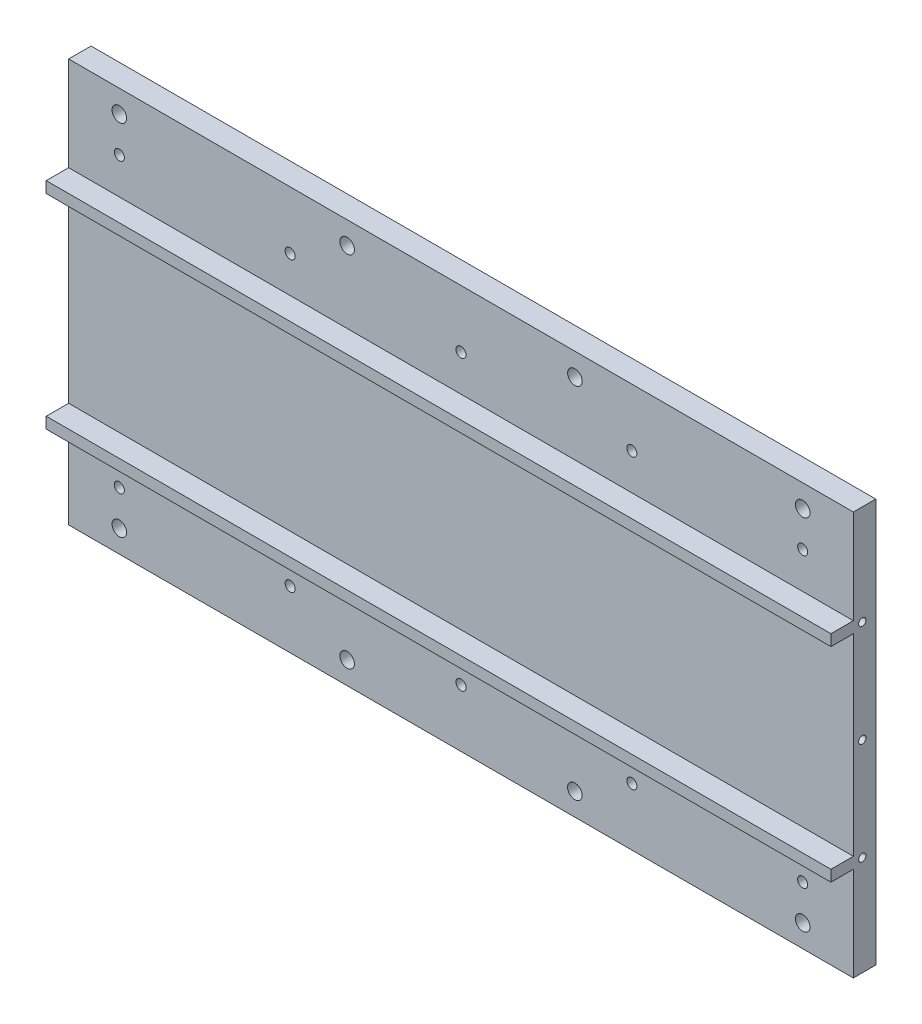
ISO-10303-21;
HEADER;
FILE_DESCRIPTION(('STEP AP214'),'2;1');
FILE_NAME('part.step','',(''),(''),'','','');
FILE_SCHEMA(('AUTOMOTIVE_DESIGN { 1 0 10303 214 1 1 1 1 }'));
ENDSEC;
DATA;
#1=APPLICATION_CONTEXT('core data for automotive mechanical design processes');
#2=APPLICATION_PROTOCOL_DEFINITION('international standard','automotive_design',2000,#1);
#3=PRODUCT_CONTEXT('',#1,'mechanical');
#4=PRODUCT('Part','Part','',(#3));
#5=PRODUCT_RELATED_PRODUCT_CATEGORY('part','',(#4));
#6=PRODUCT_DEFINITION_FORMATION('','',#4);
#7=PRODUCT_DEFINITION_CONTEXT('part definition',#1,'design');
#8=PRODUCT_DEFINITION('design','',#6,#7);
#9=PRODUCT_DEFINITION_SHAPE('','',#8);
#10=(LENGTH_UNIT() NAMED_UNIT(*) SI_UNIT(.MILLI.,.METRE.));
#11=(NAMED_UNIT(*) PLANE_ANGLE_UNIT() SI_UNIT($,.RADIAN.));
#12=(NAMED_UNIT(*) SI_UNIT($,.STERADIAN.) SOLID_ANGLE_UNIT());
#13=UNCERTAINTY_MEASURE_WITH_UNIT(LENGTH_MEASURE(1.E-05),#10,'distance_accuracy_value','');
#14=(GEOMETRIC_REPRESENTATION_CONTEXT(3) GLOBAL_UNCERTAINTY_ASSIGNED_CONTEXT((#13)) GLOBAL_UNIT_ASSIGNED_CONTEXT((#10,
#11,#12)) REPRESENTATION_CONTEXT('',''));
#15=CARTESIAN_POINT('',(0.,0.,0.));
#16=DIRECTION('',(0.,0.,1.));
#17=DIRECTION('',(1.,0.,0.));
#18=AXIS2_PLACEMENT_3D('',#15,#16,#17);
#19=CARTESIAN_POINT('',(0.,0.,0.));
#20=DIRECTION('',(0.,0.,1.));
#21=DIRECTION('',(1.,0.,0.));
#22=AXIS2_PLACEMENT_3D('',#19,#20,#21);
#23=PLANE('',#22);
#24=CARTESIAN_POINT('',(-152.4,-64.25,0.));
#25=DIRECTION('',(0.,0.,-1.));
#26=DIRECTION('',(-1.,0.,0.));
#27=AXIS2_PLACEMENT_3D('',#24,#25,#26);
#28=CIRCLE('',#27,4.);
#29=CARTESIAN_POINT('',(-156.4,-64.25,0.));
#30=VERTEX_POINT('',#29);
#31=EDGE_CURVE('E189',#30,#30,#28,.T.);
#32=ORIENTED_EDGE('',*,*,#31,.F.);
#33=EDGE_LOOP('',(#32));
#34=FACE_BOUND('',#33,.T.);
#35=CARTESIAN_POINT('',(-152.4,-80.,0.));
#36=DIRECTION('',(0.,0.,1.));
#37=DIRECTION('',(1.,0.,0.));
#38=AXIS2_PLACEMENT_3D('',#35,#36,#37);
#39=CIRCLE('',#38,3.25);
#40=CARTESIAN_POINT('',(-149.15,-80.,0.));
#41=VERTEX_POINT('',#40);
#42=EDGE_CURVE('E231',#41,#41,#39,.T.);
#43=ORIENTED_EDGE('',*,*,#42,.T.);
#44=EDGE_LOOP('',(#43));
#45=FACE_BOUND('',#44,.T.);
#46=CARTESIAN_POINT('',(-50.8,-80.,0.));
#47=DIRECTION('',(0.,0.,1.));
#48=DIRECTION('',(1.,0.,0.));
#49=AXIS2_PLACEMENT_3D('',#46,#47,#48);
#50=CIRCLE('',#49,3.25);
#51=CARTESIAN_POINT('',(-47.55,-80.,0.));
#52=VERTEX_POINT('',#51);
#53=EDGE_CURVE('E237',#52,#52,#50,.T.);
#54=ORIENTED_EDGE('',*,*,#53,.T.);
#55=EDGE_LOOP('',(#54));
#56=FACE_BOUND('',#55,.T.);
#57=CARTESIAN_POINT('',(50.8,-80.,0.));
#58=DIRECTION('',(0.,0.,1.));
#59=DIRECTION('',(1.,0.,0.));
#60=AXIS2_PLACEMENT_3D('',#57,#58,#59);
#61=CIRCLE('',#60,3.25);
#62=CARTESIAN_POINT('',(54.05,-80.,0.));
#63=VERTEX_POINT('',#62);
#64=EDGE_CURVE('E243',#63,#63,#61,.T.);
#65=ORIENTED_EDGE('',*,*,#64,.T.);
#66=EDGE_LOOP('',(#65));
#67=FACE_BOUND('',#66,.T.);
#68=CARTESIAN_POINT('',(152.4,-80.,0.));
#69=DIRECTION('',(0.,0.,1.));
#70=DIRECTION('',(1.,0.,0.));
#71=AXIS2_PLACEMENT_3D('',#68,#69,#70);
#72=CIRCLE('',#71,3.25);
#73=CARTESIAN_POINT('',(155.65,-80.,0.));
#74=VERTEX_POINT('',#73);
#75=EDGE_CURVE('E259',#74,#74,#72,.T.);
#76=ORIENTED_EDGE('',*,*,#75,.T.);
#77=EDGE_LOOP('',(#76));
#78=FACE_BOUND('',#77,.T.);
#79=CARTESIAN_POINT('',(76.2,64.25,0.));
#80=DIRECTION('',(0.,0.,-1.));
#81=DIRECTION('',(-1.,0.,0.));
#82=AXIS2_PLACEMENT_3D('',#79,#80,#81);
#83=CIRCLE('',#82,4.);
#84=CARTESIAN_POINT('',(72.2,64.25,0.));
#85=VERTEX_POINT('',#84);
#86=EDGE_CURVE('E288',#85,#85,#83,.T.);
#87=ORIENTED_EDGE('',*,*,#86,.F.);
#88=EDGE_LOOP('',(#87));
#89=FACE_BOUND('',#88,.T.);
#90=CARTESIAN_POINT('',(50.8,80.,0.));
#91=DIRECTION('',(0.,0.,1.));
#92=DIRECTION('',(1.,0.,0.));
#93=AXIS2_PLACEMENT_3D('',#90,#91,#92);
#94=CIRCLE('',#93,3.25);
#95=CARTESIAN_POINT('',(54.05,80.,0.));
#96=VERTEX_POINT('',#95);
#97=EDGE_CURVE('E300',#96,#96,#94,.T.);
#98=ORIENTED_EDGE('',*,*,#97,.T.);
#99=EDGE_LOOP('',(#98));
#100=FACE_BOUND('',#99,.T.);
#101=CARTESIAN_POINT('',(152.4,64.25,0.));
#102=DIRECTION('',(0.,0.,-1.));
#103=DIRECTION('',(-1.,0.,0.));
#104=AXIS2_PLACEMENT_3D('',#101,#102,#103);
#105=CIRCLE('',#104,4.);
#106=CARTESIAN_POINT('',(148.4,64.25,0.));
#107=VERTEX_POINT('',#106);
#108=EDGE_CURVE('E306',#107,#107,#105,.T.);
#109=ORIENTED_EDGE('',*,*,#108,.F.);
#110=EDGE_LOOP('',(#109));
#111=FACE_BOUND('',#110,.T.);
#112=CARTESIAN_POINT('',(152.4,80.,0.));
#113=DIRECTION('',(0.,0.,1.));
#114=DIRECTION('',(1.,0.,0.));
#115=AXIS2_PLACEMENT_3D('',#112,#113,#114);
#116=CIRCLE('',#115,3.25);
#117=CARTESIAN_POINT('',(155.65,80.,0.));
#118=VERTEX_POINT('',#117);
#119=EDGE_CURVE('E319',#118,#118,#116,.T.);
#120=ORIENTED_EDGE('',*,*,#119,.T.);
#121=EDGE_LOOP('',(#120));
#122=FACE_BOUND('',#121,.T.);
#123=DIRECTION('',(0.,-1.,0.));
#124=VECTOR('',#123,1.);
#125=CARTESIAN_POINT('',(-175.,90.,0.));
#126=LINE('',#125,#124);
#127=CARTESIAN_POINT('',(-175.,90.,0.));
#128=VERTEX_POINT('',#127);
#129=CARTESIAN_POINT('',(-175.,-90.,0.));
#130=VERTEX_POINT('',#129);
#131=EDGE_CURVE('E349',#128,#130,#126,.T.);
#132=ORIENTED_EDGE('',*,*,#131,.F.);
#133=DIRECTION('',(-1.,0.,0.));
#134=VECTOR('',#133,1.);
#135=CARTESIAN_POINT('',(-175.,90.,0.));
#136=LINE('',#135,#134);
#137=CARTESIAN_POINT('',(175.,90.,0.));
#138=VERTEX_POINT('',#137);
#139=EDGE_CURVE('E368',#138,#128,#136,.T.);
#140=ORIENTED_EDGE('',*,*,#139,.F.);
#141=DIRECTION('',(0.,1.,0.));
#142=VECTOR('',#141,1.);
#143=CARTESIAN_POINT('',(175.,90.,0.));
#144=LINE('',#143,#142);
#145=CARTESIAN_POINT('',(175.,-90.,0.));
#146=VERTEX_POINT('',#145);
#147=EDGE_CURVE('E366',#146,#138,#144,.T.);
#148=ORIENTED_EDGE('',*,*,#147,.F.);
#149=DIRECTION('',(1.,0.,0.));
#150=VECTOR('',#149,1.);
#151=CARTESIAN_POINT('',(-175.,-90.,0.));
#152=LINE('',#151,#150);
#153=EDGE_CURVE('E364',#130,#146,#152,.T.);
#154=ORIENTED_EDGE('',*,*,#153,.F.);
#155=EDGE_LOOP('',(#132,#140,#148,#154));
#156=FACE_BOUND('',#155,.T.);
#157=CARTESIAN_POINT('',(-50.8,80.,0.));
#158=DIRECTION('',(0.,0.,1.));
#159=DIRECTION('',(1.,0.,0.));
#160=AXIS2_PLACEMENT_3D('',#157,#158,#159);
#161=CIRCLE('',#160,3.25);
#162=CARTESIAN_POINT('',(-47.55,80.,0.));
#163=VERTEX_POINT('',#162);
#164=EDGE_CURVE('E381',#163,#163,#161,.T.);
#165=ORIENTED_EDGE('',*,*,#164,.T.);
#166=EDGE_LOOP('',(#165));
#167=FACE_BOUND('',#166,.T.);
#168=CARTESIAN_POINT('',(-152.4,80.,0.));
#169=DIRECTION('',(0.,0.,1.));
#170=DIRECTION('',(1.,0.,0.));
#171=AXIS2_PLACEMENT_3D('',#168,#169,#170);
#172=CIRCLE('',#171,3.25);
#173=CARTESIAN_POINT('',(-149.15,80.,0.));
#174=VERTEX_POINT('',#173);
#175=EDGE_CURVE('E389',#174,#174,#172,.T.);
#176=ORIENTED_EDGE('',*,*,#175,.T.);
#177=EDGE_LOOP('',(#176));
#178=FACE_BOUND('',#177,.T.);
#179=CARTESIAN_POINT('',(0.,64.25,0.));
#180=DIRECTION('',(0.,0.,-1.));
#181=DIRECTION('',(-1.,0.,0.));
#182=AXIS2_PLACEMENT_3D('',#179,#180,#181);
#183=CIRCLE('',#182,4.);
#184=CARTESIAN_POINT('',(-4.00000000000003,64.25,0.));
#185=VERTEX_POINT('',#184);
#186=EDGE_CURVE('E395',#185,#185,#183,.T.);
#187=ORIENTED_EDGE('',*,*,#186,.F.);
#188=EDGE_LOOP('',(#187));
#189=FACE_BOUND('',#188,.T.);
#190=CARTESIAN_POINT('',(-76.2000000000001,64.25,0.));
#191=DIRECTION('',(0.,0.,-1.));
#192=DIRECTION('',(-1.,0.,0.));
#193=AXIS2_PLACEMENT_3D('',#190,#191,#192);
#194=CIRCLE('',#193,4.);
#195=CARTESIAN_POINT('',(-80.2000000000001,64.25,0.));
#196=VERTEX_POINT('',#195);
#197=EDGE_CURVE('E407',#196,#196,#194,.T.);
#198=ORIENTED_EDGE('',*,*,#197,.F.);
#199=EDGE_LOOP('',(#198));
#200=FACE_BOUND('',#199,.T.);
#201=CARTESIAN_POINT('',(-152.4,64.25,0.));
#202=DIRECTION('',(0.,0.,-1.));
#203=DIRECTION('',(-1.,0.,0.));
#204=AXIS2_PLACEMENT_3D('',#201,#202,#203);
#205=CIRCLE('',#204,4.);
#206=CARTESIAN_POINT('',(-156.4,64.25,0.));
#207=VERTEX_POINT('',#206);
#208=EDGE_CURVE('E419',#207,#207,#205,.T.);
#209=ORIENTED_EDGE('',*,*,#208,.F.);
#210=EDGE_LOOP('',(#209));
#211=FACE_BOUND('',#210,.T.);
#212=CARTESIAN_POINT('',(152.4,-64.25,0.));
#213=DIRECTION('',(0.,0.,-1.));
#214=DIRECTION('',(-1.,0.,0.));
#215=AXIS2_PLACEMENT_3D('',#212,#213,#214);
#216=CIRCLE('',#215,4.);
#217=CARTESIAN_POINT('',(148.4,-64.25,0.));
#218=VERTEX_POINT('',#217);
#219=EDGE_CURVE('E246',#218,#218,#216,.T.);
#220=ORIENTED_EDGE('',*,*,#219,.F.);
#221=EDGE_LOOP('',(#220));
#222=FACE_BOUND('',#221,.T.);
#223=CARTESIAN_POINT('',(76.2,-64.25,0.));
#224=DIRECTION('',(0.,0.,-1.));
#225=DIRECTION('',(-1.,0.,0.));
#226=AXIS2_PLACEMENT_3D('',#223,#224,#225);
#227=CIRCLE('',#226,4.);
#228=CARTESIAN_POINT('',(72.2,-64.25,0.));
#229=VERTEX_POINT('',#228);
#230=EDGE_CURVE('E218',#229,#229,#227,.T.);
#231=ORIENTED_EDGE('',*,*,#230,.F.);
#232=EDGE_LOOP('',(#231));
#233=FACE_BOUND('',#232,.T.);
#234=CARTESIAN_POINT('',(0.,-64.25,0.));
#235=DIRECTION('',(0.,0.,-1.));
#236=DIRECTION('',(-1.,0.,0.));
#237=AXIS2_PLACEMENT_3D('',#234,#235,#236);
#238=CIRCLE('',#237,4.);
#239=CARTESIAN_POINT('',(-4.00000000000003,-64.25,0.));
#240=VERTEX_POINT('',#239);
#241=EDGE_CURVE('E208',#240,#240,#238,.T.);
#242=ORIENTED_EDGE('',*,*,#241,.F.);
#243=EDGE_LOOP('',(#242));
#244=FACE_BOUND('',#243,.T.);
#245=CARTESIAN_POINT('',(-76.2,-64.25,0.));
#246=DIRECTION('',(0.,0.,-1.));
#247=DIRECTION('',(-1.,0.,0.));
#248=AXIS2_PLACEMENT_3D('',#245,#246,#247);
#249=CIRCLE('',#248,4.);
#250=CARTESIAN_POINT('',(-80.2,-64.25,0.));
#251=VERTEX_POINT('',#250);
#252=EDGE_CURVE('E198',#251,#251,#249,.T.);
#253=ORIENTED_EDGE('',*,*,#252,.F.);
#254=EDGE_LOOP('',(#253));
#255=FACE_BOUND('',#254,.T.);
#256=ADVANCED_FACE('F37',(#34,#45,#56,#67,#78,#89,#100,#111,#122,#156,#167,#178,#189,#200,#211,
#222,#233,#244,#255),#23,.F.);
#257=CARTESIAN_POINT('',(0.,0.,10.));
#258=DIRECTION('',(0.,0.,1.));
#259=DIRECTION('',(1.,0.,0.));
#260=AXIS2_PLACEMENT_3D('',#257,#258,#259);
#261=PLANE('',#260);
#262=CARTESIAN_POINT('',(-152.4,-64.25,10.));
#263=DIRECTION('',(0.,0.,1.));
#264=DIRECTION('',(1.,0.,0.));
#265=AXIS2_PLACEMENT_3D('',#262,#263,#264);
#266=CIRCLE('',#265,2.25);
#267=CARTESIAN_POINT('',(-150.15,-64.25,10.));
#268=VERTEX_POINT('',#267);
#269=EDGE_CURVE('E41',#268,#268,#266,.T.);
#270=ORIENTED_EDGE('',*,*,#269,.F.);
#271=EDGE_LOOP('',(#270));
#272=FACE_BOUND('',#271,.T.);
#273=CARTESIAN_POINT('',(-76.2,-64.25,10.));
#274=DIRECTION('',(0.,0.,1.));
#275=DIRECTION('',(1.,0.,0.));
#276=AXIS2_PLACEMENT_3D('',#273,#274,#275);
#277=CIRCLE('',#276,2.25);
#278=CARTESIAN_POINT('',(-73.95,-64.25,10.));
#279=VERTEX_POINT('',#278);
#280=EDGE_CURVE('E207',#279,#279,#277,.T.);
#281=ORIENTED_EDGE('',*,*,#280,.F.);
#282=EDGE_LOOP('',(#281));
#283=FACE_BOUND('',#282,.T.);
#284=CARTESIAN_POINT('',(0.,-64.25,10.));
#285=DIRECTION('',(0.,0.,1.));
#286=DIRECTION('',(1.,0.,0.));
#287=AXIS2_PLACEMENT_3D('',#284,#285,#286);
#288=CIRCLE('',#287,2.25);
#289=CARTESIAN_POINT('',(2.24999999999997,-64.25,10.));
#290=VERTEX_POINT('',#289);
#291=EDGE_CURVE('E217',#290,#290,#288,.T.);
#292=ORIENTED_EDGE('',*,*,#291,.F.);
#293=EDGE_LOOP('',(#292));
#294=FACE_BOUND('',#293,.T.);
#295=CARTESIAN_POINT('',(76.2,-64.25,10.));
#296=DIRECTION('',(0.,0.,1.));
#297=DIRECTION('',(1.,0.,0.));
#298=AXIS2_PLACEMENT_3D('',#295,#296,#297);
#299=CIRCLE('',#298,2.25);
#300=CARTESIAN_POINT('',(78.45,-64.25,10.));
#301=VERTEX_POINT('',#300);
#302=EDGE_CURVE('E227',#301,#301,#299,.T.);
#303=ORIENTED_EDGE('',*,*,#302,.F.);
#304=EDGE_LOOP('',(#303));
#305=FACE_BOUND('',#304,.T.);
#306=CARTESIAN_POINT('',(-152.4,-80.,10.));
#307=DIRECTION('',(0.,0.,1.));
#308=DIRECTION('',(1.,0.,0.));
#309=AXIS2_PLACEMENT_3D('',#306,#307,#308);
#310=CIRCLE('',#309,3.25);
#311=CARTESIAN_POINT('',(-149.15,-80.,10.));
#312=VERTEX_POINT('',#311);
#313=EDGE_CURVE('E228',#312,#312,#310,.T.);
#314=ORIENTED_EDGE('',*,*,#313,.F.);
#315=EDGE_LOOP('',(#314));
#316=FACE_BOUND('',#315,.T.);
#317=CARTESIAN_POINT('',(-50.8,-80.,10.));
#318=DIRECTION('',(0.,0.,1.));
#319=DIRECTION('',(1.,0.,0.));
#320=AXIS2_PLACEMENT_3D('',#317,#318,#319);
#321=CIRCLE('',#320,3.25);
#322=CARTESIAN_POINT('',(-47.55,-80.,10.));
#323=VERTEX_POINT('',#322);
#324=EDGE_CURVE('E234',#323,#323,#321,.T.);
#325=ORIENTED_EDGE('',*,*,#324,.F.);
#326=EDGE_LOOP('',(#325));
#327=FACE_BOUND('',#326,.T.);
#328=CARTESIAN_POINT('',(50.8,-80.,10.));
#329=DIRECTION('',(0.,0.,1.));
#330=DIRECTION('',(1.,0.,0.));
#331=AXIS2_PLACEMENT_3D('',#328,#329,#330);
#332=CIRCLE('',#331,3.25);
#333=CARTESIAN_POINT('',(54.05,-80.,10.));
#334=VERTEX_POINT('',#333);
#335=EDGE_CURVE('E240',#334,#334,#332,.T.);
#336=ORIENTED_EDGE('',*,*,#335,.F.);
#337=EDGE_LOOP('',(#336));
#338=FACE_BOUND('',#337,.T.);
#339=CARTESIAN_POINT('',(152.4,-64.25,10.));
#340=DIRECTION('',(0.,0.,1.));
#341=DIRECTION('',(1.,0.,0.));
#342=AXIS2_PLACEMENT_3D('',#339,#340,#341);
#343=CIRCLE('',#342,2.25);
#344=CARTESIAN_POINT('',(154.65,-64.25,10.));
#345=VERTEX_POINT('',#344);
#346=EDGE_CURVE('E255',#345,#345,#343,.T.);
#347=ORIENTED_EDGE('',*,*,#346,.F.);
#348=EDGE_LOOP('',(#347));
#349=FACE_BOUND('',#348,.T.);
#350=CARTESIAN_POINT('',(152.4,-80.,10.));
#351=DIRECTION('',(0.,0.,1.));
#352=DIRECTION('',(1.,0.,0.));
#353=AXIS2_PLACEMENT_3D('',#350,#351,#352);
#354=CIRCLE('',#353,3.25);
#355=CARTESIAN_POINT('',(155.65,-80.,10.));
#356=VERTEX_POINT('',#355);
#357=EDGE_CURVE('E256',#356,#356,#354,.T.);
#358=ORIENTED_EDGE('',*,*,#357,.F.);
#359=EDGE_LOOP('',(#358));
#360=FACE_BOUND('',#359,.T.);
#361=DIRECTION('',(-1.,0.,0.));
#362=VECTOR('',#361,1.);
#363=CARTESIAN_POINT('',(-175.,-48.,10.));
#364=LINE('',#363,#362);
#365=CARTESIAN_POINT('',(175.,-48.,10.));
#366=VERTEX_POINT('',#365);
#367=CARTESIAN_POINT('',(-175.,-48.,10.));
#368=VERTEX_POINT('',#367);
#369=EDGE_CURVE('E262',#366,#368,#364,.T.);
#370=ORIENTED_EDGE('',*,*,#369,.T.);
#371=DIRECTION('',(0.,-1.,0.));
#372=VECTOR('',#371,1.);
#373=CARTESIAN_POINT('',(-175.,90.,10.));
#374=LINE('',#373,#372);
#375=CARTESIAN_POINT('',(-175.,-90.,10.));
#376=VERTEX_POINT('',#375);
#377=EDGE_CURVE('E354',#368,#376,#374,.T.);
#378=ORIENTED_EDGE('',*,*,#377,.T.);
#379=DIRECTION('',(1.,0.,0.));
#380=VECTOR('',#379,1.);
#381=CARTESIAN_POINT('',(-175.,-90.,10.));
#382=LINE('',#381,#380);
#383=CARTESIAN_POINT('',(175.,-90.,10.));
#384=VERTEX_POINT('',#383);
#385=EDGE_CURVE('E352',#376,#384,#382,.T.);
#386=ORIENTED_EDGE('',*,*,#385,.T.);
#387=DIRECTION('',(0.,1.,0.));
#388=VECTOR('',#387,1.);
#389=CARTESIAN_POINT('',(175.,90.,10.));
#390=LINE('',#389,#388);
#391=EDGE_CURVE('E62',#384,#366,#390,.T.);
#392=ORIENTED_EDGE('',*,*,#391,.T.);
#393=EDGE_LOOP('',(#370,#378,#386,#392));
#394=FACE_BOUND('',#393,.T.);
#395=ADVANCED_FACE('F438',(#272,#283,#294,#305,#316,#327,#338,#349,#360,#394),#261,.T.);
#396=CARTESIAN_POINT('',(76.2,64.25,10.));
#397=DIRECTION('',(0.,0.,1.));
#398=DIRECTION('',(1.,0.,0.));
#399=AXIS2_PLACEMENT_3D('',#396,#397,#398);
#400=CIRCLE('',#399,2.25);
#401=CARTESIAN_POINT('',(78.45,64.25,10.));
#402=VERTEX_POINT('',#401);
#403=EDGE_CURVE('E291',#402,#402,#400,.T.);
#404=ORIENTED_EDGE('',*,*,#403,.F.);
#405=EDGE_LOOP('',(#404));
#406=FACE_BOUND('',#405,.T.);
#407=CARTESIAN_POINT('',(50.8,80.,10.));
#408=DIRECTION('',(0.,0.,1.));
#409=DIRECTION('',(1.,0.,0.));
#410=AXIS2_PLACEMENT_3D('',#407,#408,#409);
#411=CIRCLE('',#410,3.25);
#412=CARTESIAN_POINT('',(54.05,80.,10.));
#413=VERTEX_POINT('',#412);
#414=EDGE_CURVE('E303',#413,#413,#411,.T.);
#415=ORIENTED_EDGE('',*,*,#414,.F.);
#416=EDGE_LOOP('',(#415));
#417=FACE_BOUND('',#416,.T.);
#418=CARTESIAN_POINT('',(152.4,64.25,10.));
#419=DIRECTION('',(0.,0.,1.));
#420=DIRECTION('',(1.,0.,0.));
#421=AXIS2_PLACEMENT_3D('',#418,#419,#420);
#422=CIRCLE('',#421,2.25);
#423=CARTESIAN_POINT('',(154.65,64.25,10.));
#424=VERTEX_POINT('',#423);
#425=EDGE_CURVE('E315',#424,#424,#422,.T.);
#426=ORIENTED_EDGE('',*,*,#425,.F.);
#427=EDGE_LOOP('',(#426));
#428=FACE_BOUND('',#427,.T.);
#429=CARTESIAN_POINT('',(152.4,80.,10.));
#430=DIRECTION('',(0.,0.,1.));
#431=DIRECTION('',(1.,0.,0.));
#432=AXIS2_PLACEMENT_3D('',#429,#430,#431);
#433=CIRCLE('',#432,3.25);
#434=CARTESIAN_POINT('',(155.65,80.,10.));
#435=VERTEX_POINT('',#434);
#436=EDGE_CURVE('E316',#435,#435,#433,.T.);
#437=ORIENTED_EDGE('',*,*,#436,.F.);
#438=EDGE_LOOP('',(#437));
#439=FACE_BOUND('',#438,.T.);
#440=DIRECTION('',(-1.,0.,0.));
#441=VECTOR('',#440,1.);
#442=CARTESIAN_POINT('',(-175.,48.,10.));
#443=LINE('',#442,#441);
#444=CARTESIAN_POINT('',(175.,48.,10.));
#445=VERTEX_POINT('',#444);
#446=CARTESIAN_POINT('',(-175.,48.,10.));
#447=VERTEX_POINT('',#446);
#448=EDGE_CURVE('E327',#445,#447,#443,.T.);
#449=ORIENTED_EDGE('',*,*,#448,.F.);
#450=CARTESIAN_POINT('',(175.,90.,10.));
#451=VERTEX_POINT('',#450);
#452=EDGE_CURVE('E356',#445,#451,#390,.T.);
#453=ORIENTED_EDGE('',*,*,#452,.T.);
#454=DIRECTION('',(-1.,0.,0.));
#455=VECTOR('',#454,1.);
#456=CARTESIAN_POINT('',(-175.,90.,10.));
#457=LINE('',#456,#455);
#458=CARTESIAN_POINT('',(-175.,90.,10.));
#459=VERTEX_POINT('',#458);
#460=EDGE_CURVE('E358',#451,#459,#457,.T.);
#461=ORIENTED_EDGE('',*,*,#460,.T.);
#462=EDGE_CURVE('E350',#459,#447,#374,.T.);
#463=ORIENTED_EDGE('',*,*,#462,.T.);
#464=EDGE_LOOP('',(#449,#453,#461,#463));
#465=FACE_BOUND('',#464,.T.);
#466=CARTESIAN_POINT('',(-50.8,80.,10.));
#467=DIRECTION('',(0.,0.,1.));
#468=DIRECTION('',(1.,0.,0.));
#469=AXIS2_PLACEMENT_3D('',#466,#467,#468);
#470=CIRCLE('',#469,3.25);
#471=CARTESIAN_POINT('',(-47.55,80.,10.));
#472=VERTEX_POINT('',#471);
#473=EDGE_CURVE('E386',#472,#472,#470,.T.);
#474=ORIENTED_EDGE('',*,*,#473,.F.);
#475=EDGE_LOOP('',(#474));
#476=FACE_BOUND('',#475,.T.);
#477=CARTESIAN_POINT('',(-152.4,80.,10.));
#478=DIRECTION('',(0.,0.,1.));
#479=DIRECTION('',(1.,0.,0.));
#480=AXIS2_PLACEMENT_3D('',#477,#478,#479);
#481=CIRCLE('',#480,3.25);
#482=CARTESIAN_POINT('',(-149.15,80.,10.));
#483=VERTEX_POINT('',#482);
#484=EDGE_CURVE('E392',#483,#483,#481,.T.);
#485=ORIENTED_EDGE('',*,*,#484,.F.);
#486=EDGE_LOOP('',(#485));
#487=FACE_BOUND('',#486,.T.);
#488=CARTESIAN_POINT('',(0.,64.25,10.));
#489=DIRECTION('',(0.,0.,1.));
#490=DIRECTION('',(1.,0.,0.));
#491=AXIS2_PLACEMENT_3D('',#488,#489,#490);
#492=CIRCLE('',#491,2.25);
#493=CARTESIAN_POINT('',(2.24999999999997,64.25,10.));
#494=VERTEX_POINT('',#493);
#495=EDGE_CURVE('E398',#494,#494,#492,.T.);
#496=ORIENTED_EDGE('',*,*,#495,.F.);
#497=EDGE_LOOP('',(#496));
#498=FACE_BOUND('',#497,.T.);
#499=CARTESIAN_POINT('',(-76.2000000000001,64.25,10.));
#500=DIRECTION('',(0.,0.,1.));
#501=DIRECTION('',(1.,0.,0.));
#502=AXIS2_PLACEMENT_3D('',#499,#500,#501);
#503=CIRCLE('',#502,2.25);
#504=CARTESIAN_POINT('',(-73.9500000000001,64.25,10.));
#505=VERTEX_POINT('',#504);
#506=EDGE_CURVE('E410',#505,#505,#503,.T.);
#507=ORIENTED_EDGE('',*,*,#506,.F.);
#508=EDGE_LOOP('',(#507));
#509=FACE_BOUND('',#508,.T.);
#510=CARTESIAN_POINT('',(-152.4,64.25,10.));
#511=DIRECTION('',(0.,0.,1.));
#512=DIRECTION('',(1.,0.,0.));
#513=AXIS2_PLACEMENT_3D('',#510,#511,#512);
#514=CIRCLE('',#513,2.25);
#515=CARTESIAN_POINT('',(-150.15,64.25,10.));
#516=VERTEX_POINT('',#515);
#517=EDGE_CURVE('E422',#516,#516,#514,.T.);
#518=ORIENTED_EDGE('',*,*,#517,.F.);
#519=EDGE_LOOP('',(#518));
#520=FACE_BOUND('',#519,.T.);
#521=ADVANCED_FACE('F441',(#406,#417,#428,#439,#465,#476,#487,#498,#509,#520),#261,.T.);
#522=CARTESIAN_POINT('',(-175.,90.,10.));
#523=DIRECTION('',(1.,0.,0.));
#524=DIRECTION('',(0.,0.,-1.));
#525=AXIS2_PLACEMENT_3D('',#522,#523,#524);
#526=PLANE('',#525);
#527=CARTESIAN_POINT('',(-175.,45.5,6.));
#528=DIRECTION('',(-1.,0.,0.));
#529=DIRECTION('',(0.,0.,1.));
#530=AXIS2_PLACEMENT_3D('',#527,#528,#529);
#531=CIRCLE('',#530,1.64999999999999);
#532=CARTESIAN_POINT('',(-175.,45.5,7.64999999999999));
#533=VERTEX_POINT('',#532);
#534=EDGE_CURVE('E155',#533,#533,#531,.T.);
#535=ORIENTED_EDGE('',*,*,#534,.F.);
#536=EDGE_LOOP('',(#535));
#537=FACE_BOUND('',#536,.T.);
#538=CARTESIAN_POINT('',(-175.,-45.5,6.));
#539=DIRECTION('',(-1.,0.,0.));
#540=DIRECTION('',(0.,0.,1.));
#541=AXIS2_PLACEMENT_3D('',#538,#539,#540);
#542=CIRCLE('',#541,1.64999999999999);
#543=CARTESIAN_POINT('',(-175.,-45.5,7.64999999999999));
#544=VERTEX_POINT('',#543);
#545=EDGE_CURVE('E154',#544,#544,#542,.T.);
#546=ORIENTED_EDGE('',*,*,#545,.F.);
#547=EDGE_LOOP('',(#546));
#548=FACE_BOUND('',#547,.T.);
#549=CARTESIAN_POINT('',(-175.,0.,6.));
#550=DIRECTION('',(-1.,0.,0.));
#551=DIRECTION('',(0.,0.,1.));
#552=AXIS2_PLACEMENT_3D('',#549,#550,#551);
#553=CIRCLE('',#552,1.64999999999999);
#554=CARTESIAN_POINT('',(-175.,0.,7.64999999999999));
#555=VERTEX_POINT('',#554);
#556=EDGE_CURVE('E165',#555,#555,#553,.T.);
#557=ORIENTED_EDGE('',*,*,#556,.F.);
#558=EDGE_LOOP('',(#557));
#559=FACE_BOUND('',#558,.T.);
#560=ORIENTED_EDGE('',*,*,#131,.T.);
#561=DIRECTION('',(0.,0.,-1.));
#562=VECTOR('',#561,1.);
#563=CARTESIAN_POINT('',(-175.,-90.,10.));
#564=LINE('',#563,#562);
#565=EDGE_CURVE('E378',#376,#130,#564,.T.);
#566=ORIENTED_EDGE('',*,*,#565,.F.);
#567=ORIENTED_EDGE('',*,*,#377,.F.);
#568=DIRECTION('',(0.,0.,-1.));
#569=VECTOR('',#568,1.);
#570=CARTESIAN_POINT('',(-175.,-48.,20.));
#571=LINE('',#570,#569);
#572=CARTESIAN_POINT('',(-175.,-48.,20.));
#573=VERTEX_POINT('',#572);
#574=EDGE_CURVE('E285',#573,#368,#571,.T.);
#575=ORIENTED_EDGE('',*,*,#574,.F.);
#576=DIRECTION('',(0.,1.,0.));
#577=VECTOR('',#576,1.);
#578=CARTESIAN_POINT('',(-175.,-48.,20.));
#579=LINE('',#578,#577);
#580=CARTESIAN_POINT('',(-175.,-43.,20.));
#581=VERTEX_POINT('',#580);
#582=EDGE_CURVE('E263',#573,#581,#579,.T.);
#583=ORIENTED_EDGE('',*,*,#582,.T.);
#584=DIRECTION('',(0.,0.,-1.));
#585=VECTOR('',#584,1.);
#586=CARTESIAN_POINT('',(-175.,-43.,20.));
#587=LINE('',#586,#585);
#588=CARTESIAN_POINT('',(-175.,-43.,10.));
#589=VERTEX_POINT('',#588);
#590=EDGE_CURVE('E275',#581,#589,#587,.T.);
#591=ORIENTED_EDGE('',*,*,#590,.T.);
#592=CARTESIAN_POINT('',(-175.,43.,10.));
#593=VERTEX_POINT('',#592);
#594=EDGE_CURVE('E353',#593,#589,#374,.T.);
#595=ORIENTED_EDGE('',*,*,#594,.F.);
#596=DIRECTION('',(0.,0.,-1.));
#597=VECTOR('',#596,1.);
#598=CARTESIAN_POINT('',(-175.,43.,20.));
#599=LINE('',#598,#597);
#600=CARTESIAN_POINT('',(-175.,43.,20.));
#601=VERTEX_POINT('',#600);
#602=EDGE_CURVE('E346',#601,#593,#599,.T.);
#603=ORIENTED_EDGE('',*,*,#602,.F.);
#604=DIRECTION('',(0.,-1.,0.));
#605=VECTOR('',#604,1.);
#606=CARTESIAN_POINT('',(-175.,48.,20.));
#607=LINE('',#606,#605);
#608=CARTESIAN_POINT('',(-175.,48.,20.));
#609=VERTEX_POINT('',#608);
#610=EDGE_CURVE('E323',#609,#601,#607,.T.);
#611=ORIENTED_EDGE('',*,*,#610,.F.);
#612=DIRECTION('',(0.,0.,-1.));
#613=VECTOR('',#612,1.);
#614=CARTESIAN_POINT('',(-175.,48.,20.));
#615=LINE('',#614,#613);
#616=EDGE_CURVE('E333',#609,#447,#615,.T.);
#617=ORIENTED_EDGE('',*,*,#616,.T.);
#618=ORIENTED_EDGE('',*,*,#462,.F.);
#619=DIRECTION('',(0.,0.,-1.));
#620=VECTOR('',#619,1.);
#621=CARTESIAN_POINT('',(-175.,90.,10.));
#622=LINE('',#621,#620);
#623=EDGE_CURVE('E361',#459,#128,#622,.T.);
#624=ORIENTED_EDGE('',*,*,#623,.T.);
#625=EDGE_LOOP('',(#560,#566,#567,#575,#583,#591,#595,#603,#611,#617,#618,#624));
#626=FACE_BOUND('',#625,.T.);
#627=ADVANCED_FACE('F464',(#537,#548,#559,#626),#526,.F.);
#628=CARTESIAN_POINT('',(-175.,-90.,10.));
#629=DIRECTION('',(0.,1.,0.));
#630=DIRECTION('',(0.,0.,1.));
#631=AXIS2_PLACEMENT_3D('',#628,#629,#630);
#632=PLANE('',#631);
#633=ORIENTED_EDGE('',*,*,#153,.T.);
#634=DIRECTION('',(0.,0.,-1.));
#635=VECTOR('',#634,1.);
#636=CARTESIAN_POINT('',(175.,-90.,10.));
#637=LINE('',#636,#635);
#638=EDGE_CURVE('E375',#384,#146,#637,.T.);
#639=ORIENTED_EDGE('',*,*,#638,.F.);
#640=ORIENTED_EDGE('',*,*,#385,.F.);
#641=ORIENTED_EDGE('',*,*,#565,.T.);
#642=EDGE_LOOP('',(#633,#639,#640,#641));
#643=FACE_BOUND('',#642,.T.);
#644=ADVANCED_FACE('F517',(#643),#632,.F.);
#645=CARTESIAN_POINT('',(175.,90.,10.));
#646=DIRECTION('',(-1.,0.,0.));
#647=DIRECTION('',(0.,0.,1.));
#648=AXIS2_PLACEMENT_3D('',#645,#646,#647);
#649=PLANE('',#648);
#650=CARTESIAN_POINT('',(175.,45.5,6.));
#651=DIRECTION('',(1.,0.,0.));
#652=DIRECTION('',(0.,0.,-1.));
#653=AXIS2_PLACEMENT_3D('',#650,#651,#652);
#654=CIRCLE('',#653,1.64999999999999);
#655=CARTESIAN_POINT('',(175.,45.5,4.35000000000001));
#656=VERTEX_POINT('',#655);
#657=EDGE_CURVE('E171',#656,#656,#654,.T.);
#658=ORIENTED_EDGE('',*,*,#657,.F.);
#659=EDGE_LOOP('',(#658));
#660=FACE_BOUND('',#659,.T.);
#661=CARTESIAN_POINT('',(175.,-45.5,6.));
#662=DIRECTION('',(1.,0.,0.));
#663=DIRECTION('',(0.,0.,-1.));
#664=AXIS2_PLACEMENT_3D('',#661,#662,#663);
#665=CIRCLE('',#664,1.64999999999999);
#666=CARTESIAN_POINT('',(175.,-45.5,4.35000000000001));
#667=VERTEX_POINT('',#666);
#668=EDGE_CURVE('E177',#667,#667,#665,.T.);
#669=ORIENTED_EDGE('',*,*,#668,.F.);
#670=EDGE_LOOP('',(#669));
#671=FACE_BOUND('',#670,.T.);
#672=CARTESIAN_POINT('',(175.,0.,6.));
#673=DIRECTION('',(1.,0.,0.));
#674=DIRECTION('',(0.,0.,-1.));
#675=AXIS2_PLACEMENT_3D('',#672,#673,#674);
#676=CIRCLE('',#675,1.64999999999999);
#677=CARTESIAN_POINT('',(175.,0.,4.35000000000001));
#678=VERTEX_POINT('',#677);
#679=EDGE_CURVE('E183',#678,#678,#676,.T.);
#680=ORIENTED_EDGE('',*,*,#679,.F.);
#681=EDGE_LOOP('',(#680));
#682=FACE_BOUND('',#681,.T.);
#683=ORIENTED_EDGE('',*,*,#147,.T.);
#684=DIRECTION('',(0.,0.,-1.));
#685=VECTOR('',#684,1.);
#686=CARTESIAN_POINT('',(175.,90.,10.));
#687=LINE('',#686,#685);
#688=EDGE_CURVE('E372',#451,#138,#687,.T.);
#689=ORIENTED_EDGE('',*,*,#688,.F.);
#690=ORIENTED_EDGE('',*,*,#452,.F.);
#691=DIRECTION('',(0.,0.,-1.));
#692=VECTOR('',#691,1.);
#693=CARTESIAN_POINT('',(175.,48.,20.));
#694=LINE('',#693,#692);
#695=CARTESIAN_POINT('',(175.,48.,20.));
#696=VERTEX_POINT('',#695);
#697=EDGE_CURVE('E340',#696,#445,#694,.T.);
#698=ORIENTED_EDGE('',*,*,#697,.F.);
#699=DIRECTION('',(0.,1.,0.));
#700=VECTOR('',#699,1.);
#701=CARTESIAN_POINT('',(175.,48.,20.));
#702=LINE('',#701,#700);
#703=CARTESIAN_POINT('',(175.,43.,20.));
#704=VERTEX_POINT('',#703);
#705=EDGE_CURVE('E329',#704,#696,#702,.T.);
#706=ORIENTED_EDGE('',*,*,#705,.F.);
#707=DIRECTION('',(0.,0.,-1.));
#708=VECTOR('',#707,1.);
#709=CARTESIAN_POINT('',(175.,43.,20.));
#710=LINE('',#709,#708);
#711=CARTESIAN_POINT('',(175.,43.,10.));
#712=VERTEX_POINT('',#711);
#713=EDGE_CURVE('E343',#704,#712,#710,.T.);
#714=ORIENTED_EDGE('',*,*,#713,.T.);
#715=CARTESIAN_POINT('',(175.,-43.,10.));
#716=VERTEX_POINT('',#715);
#717=EDGE_CURVE('E359',#716,#712,#390,.T.);
#718=ORIENTED_EDGE('',*,*,#717,.F.);
#719=DIRECTION('',(0.,0.,-1.));
#720=VECTOR('',#719,1.);
#721=CARTESIAN_POINT('',(175.,-43.,20.));
#722=LINE('',#721,#720);
#723=CARTESIAN_POINT('',(175.,-43.,20.));
#724=VERTEX_POINT('',#723);
#725=EDGE_CURVE('E280',#724,#716,#722,.T.);
#726=ORIENTED_EDGE('',*,*,#725,.F.);
#727=DIRECTION('',(0.,-1.,0.));
#728=VECTOR('',#727,1.);
#729=CARTESIAN_POINT('',(175.,-48.,20.));
#730=LINE('',#729,#728);
#731=CARTESIAN_POINT('',(175.,-48.,20.));
#732=VERTEX_POINT('',#731);
#733=EDGE_CURVE('E269',#724,#732,#730,.T.);
#734=ORIENTED_EDGE('',*,*,#733,.T.);
#735=DIRECTION('',(0.,0.,-1.));
#736=VECTOR('',#735,1.);
#737=CARTESIAN_POINT('',(175.,-48.,20.));
#738=LINE('',#737,#736);
#739=EDGE_CURVE('E283',#732,#366,#738,.T.);
#740=ORIENTED_EDGE('',*,*,#739,.T.);
#741=ORIENTED_EDGE('',*,*,#391,.F.);
#742=ORIENTED_EDGE('',*,*,#638,.T.);
#743=EDGE_LOOP('',(#683,#689,#690,#698,#706,#714,#718,#726,#734,#740,#741,#742));
#744=FACE_BOUND('',#743,.T.);
#745=ADVANCED_FACE('F473',(#660,#671,#682,#744),#649,.F.);
#746=CARTESIAN_POINT('',(-175.,90.,10.));
#747=DIRECTION('',(0.,-1.,0.));
#748=DIRECTION('',(0.,0.,-1.));
#749=AXIS2_PLACEMENT_3D('',#746,#747,#748);
#750=PLANE('',#749);
#751=ORIENTED_EDGE('',*,*,#139,.T.);
#752=ORIENTED_EDGE('',*,*,#623,.F.);
#753=ORIENTED_EDGE('',*,*,#460,.F.);
#754=ORIENTED_EDGE('',*,*,#688,.T.);
#755=EDGE_LOOP('',(#751,#752,#753,#754));
#756=FACE_BOUND('',#755,.T.);
#757=ADVANCED_FACE('F497',(#756),#750,.F.);
#758=DIRECTION('',(1.,0.,0.));
#759=VECTOR('',#758,1.);
#760=CARTESIAN_POINT('',(-175.,-43.,10.));
#761=LINE('',#760,#759);
#762=EDGE_CURVE('E54',#589,#716,#761,.T.);
#763=ORIENTED_EDGE('',*,*,#762,.T.);
#764=ORIENTED_EDGE('',*,*,#717,.T.);
#765=DIRECTION('',(1.,0.,0.));
#766=VECTOR('',#765,1.);
#767=CARTESIAN_POINT('',(-175.,43.,10.));
#768=LINE('',#767,#766);
#769=EDGE_CURVE('E322',#593,#712,#768,.T.);
#770=ORIENTED_EDGE('',*,*,#769,.F.);
#771=ORIENTED_EDGE('',*,*,#594,.T.);
#772=EDGE_LOOP('',(#763,#764,#770,#771));
#773=FACE_BOUND('',#772,.T.);
#774=ADVANCED_FACE('F444',(#773),#261,.T.);
#775=CARTESIAN_POINT('',(-175.,43.,20.));
#776=DIRECTION('',(0.,1.,0.));
#777=DIRECTION('',(-1.,0.,0.));
#778=AXIS2_PLACEMENT_3D('',#775,#776,#777);
#779=PLANE('',#778);
#780=ORIENTED_EDGE('',*,*,#769,.T.);
#781=ORIENTED_EDGE('',*,*,#713,.F.);
#782=DIRECTION('',(1.,0.,0.));
#783=VECTOR('',#782,1.);
#784=CARTESIAN_POINT('',(-175.,43.,20.));
#785=LINE('',#784,#783);
#786=EDGE_CURVE('E326',#601,#704,#785,.T.);
#787=ORIENTED_EDGE('',*,*,#786,.F.);
#788=ORIENTED_EDGE('',*,*,#602,.T.);
#789=EDGE_LOOP('',(#780,#781,#787,#788));
#790=FACE_BOUND('',#789,.T.);
#791=ADVANCED_FACE('F480',(#790),#779,.F.);
#792=CARTESIAN_POINT('',(-175.,48.,20.));
#793=DIRECTION('',(0.,-1.,0.));
#794=DIRECTION('',(0.,0.,-1.));
#795=AXIS2_PLACEMENT_3D('',#792,#793,#794);
#796=PLANE('',#795);
#797=ORIENTED_EDGE('',*,*,#448,.T.);
#798=ORIENTED_EDGE('',*,*,#616,.F.);
#799=DIRECTION('',(-1.,0.,0.));
#800=VECTOR('',#799,1.);
#801=CARTESIAN_POINT('',(-175.,48.,20.));
#802=LINE('',#801,#800);
#803=EDGE_CURVE('E331',#696,#609,#802,.T.);
#804=ORIENTED_EDGE('',*,*,#803,.F.);
#805=ORIENTED_EDGE('',*,*,#697,.T.);
#806=EDGE_LOOP('',(#797,#798,#804,#805));
#807=FACE_BOUND('',#806,.T.);
#808=ADVANCED_FACE('F489',(#807),#796,.F.);
#809=CARTESIAN_POINT('',(0.,0.,20.));
#810=DIRECTION('',(0.,0.,1.));
#811=DIRECTION('',(1.,0.,0.));
#812=AXIS2_PLACEMENT_3D('',#809,#810,#811);
#813=PLANE('',#812);
#814=ORIENTED_EDGE('',*,*,#610,.T.);
#815=ORIENTED_EDGE('',*,*,#786,.T.);
#816=ORIENTED_EDGE('',*,*,#705,.T.);
#817=ORIENTED_EDGE('',*,*,#803,.T.);
#818=EDGE_LOOP('',(#814,#815,#816,#817));
#819=FACE_BOUND('',#818,.T.);
#820=ADVANCED_FACE('F484',(#819),#813,.T.);
#821=CARTESIAN_POINT('',(152.4,80.,10.));
#822=DIRECTION('',(0.,0.,1.));
#823=DIRECTION('',(1.,0.,0.));
#824=AXIS2_PLACEMENT_3D('',#821,#822,#823);
#825=CYLINDRICAL_SURFACE('',#824,3.25);
#826=ORIENTED_EDGE('',*,*,#119,.F.);
#827=EDGE_LOOP('',(#826));
#828=FACE_BOUND('',#827,.T.);
#829=ORIENTED_EDGE('',*,*,#436,.T.);
#830=EDGE_LOOP('',(#829));
#831=FACE_BOUND('',#830,.T.);
#832=ADVANCED_FACE('F687',(#828,#831),#825,.F.);
#833=CARTESIAN_POINT('',(152.4,64.25,0.));
#834=DIRECTION('',(0.,0.,-1.));
#835=DIRECTION('',(-1.,0.,0.));
#836=AXIS2_PLACEMENT_3D('',#833,#834,#835);
#837=CYLINDRICAL_SURFACE('',#836,2.25);
#838=ORIENTED_EDGE('',*,*,#425,.T.);
#839=EDGE_LOOP('',(#838));
#840=FACE_BOUND('',#839,.T.);
#841=CARTESIAN_POINT('',(152.4,64.25,4.5));
#842=DIRECTION('',(0.,0.,-1.));
#843=DIRECTION('',(-1.,0.,0.));
#844=AXIS2_PLACEMENT_3D('',#841,#842,#843);
#845=CIRCLE('',#844,2.25);
#846=CARTESIAN_POINT('',(150.15,64.25,4.5));
#847=VERTEX_POINT('',#846);
#848=EDGE_CURVE('E312',#847,#847,#845,.T.);
#849=ORIENTED_EDGE('',*,*,#848,.T.);
#850=EDGE_LOOP('',(#849));
#851=FACE_BOUND('',#850,.T.);
#852=ADVANCED_FACE('F683',(#840,#851),#837,.F.);
#853=CARTESIAN_POINT('',(154.65,64.25,4.5));
#854=DIRECTION('',(0.,0.,1.));
#855=DIRECTION('',(1.,0.,0.));
#856=AXIS2_PLACEMENT_3D('',#853,#854,#855);
#857=PLANE('',#856);
#858=ORIENTED_EDGE('',*,*,#848,.F.);
#859=EDGE_LOOP('',(#858));
#860=FACE_BOUND('',#859,.T.);
#861=CARTESIAN_POINT('',(152.4,64.25,4.5));
#862=DIRECTION('',(0.,0.,-1.));
#863=DIRECTION('',(-1.,0.,0.));
#864=AXIS2_PLACEMENT_3D('',#861,#862,#863);
#865=CIRCLE('',#864,4.);
#866=CARTESIAN_POINT('',(148.4,64.25,4.5));
#867=VERTEX_POINT('',#866);
#868=EDGE_CURVE('E309',#867,#867,#865,.T.);
#869=ORIENTED_EDGE('',*,*,#868,.T.);
#870=EDGE_LOOP('',(#869));
#871=FACE_BOUND('',#870,.T.);
#872=ADVANCED_FACE('F679',(#860,#871),#857,.F.);
#873=CARTESIAN_POINT('',(152.4,64.25,0.));
#874=DIRECTION('',(0.,0.,-1.));
#875=DIRECTION('',(-1.,0.,0.));
#876=AXIS2_PLACEMENT_3D('',#873,#874,#875);
#877=CYLINDRICAL_SURFACE('',#876,4.);
#878=ORIENTED_EDGE('',*,*,#868,.F.);
#879=EDGE_LOOP('',(#878));
#880=FACE_BOUND('',#879,.T.);
#881=ORIENTED_EDGE('',*,*,#108,.T.);
#882=EDGE_LOOP('',(#881));
#883=FACE_BOUND('',#882,.T.);
#884=ADVANCED_FACE('F675',(#880,#883),#877,.F.);
#885=CARTESIAN_POINT('',(50.8,80.,10.));
#886=DIRECTION('',(0.,0.,1.));
#887=DIRECTION('',(1.,0.,0.));
#888=AXIS2_PLACEMENT_3D('',#885,#886,#887);
#889=CYLINDRICAL_SURFACE('',#888,3.25);
#890=ORIENTED_EDGE('',*,*,#97,.F.);
#891=EDGE_LOOP('',(#890));
#892=FACE_BOUND('',#891,.T.);
#893=ORIENTED_EDGE('',*,*,#414,.T.);
#894=EDGE_LOOP('',(#893));
#895=FACE_BOUND('',#894,.T.);
#896=ADVANCED_FACE('F529',(#892,#895),#889,.F.);
#897=CARTESIAN_POINT('',(-50.8,80.,10.));
#898=DIRECTION('',(0.,0.,1.));
#899=DIRECTION('',(1.,0.,0.));
#900=AXIS2_PLACEMENT_3D('',#897,#898,#899);
#901=CYLINDRICAL_SURFACE('',#900,3.25);
#902=ORIENTED_EDGE('',*,*,#164,.F.);
#903=EDGE_LOOP('',(#902));
#904=FACE_BOUND('',#903,.T.);
#905=ORIENTED_EDGE('',*,*,#473,.T.);
#906=EDGE_LOOP('',(#905));
#907=FACE_BOUND('',#906,.T.);
#908=ADVANCED_FACE('F525',(#904,#907),#901,.F.);
#909=CARTESIAN_POINT('',(-152.4,80.,10.));
#910=DIRECTION('',(0.,0.,1.));
#911=DIRECTION('',(1.,0.,0.));
#912=AXIS2_PLACEMENT_3D('',#909,#910,#911);
#913=CYLINDRICAL_SURFACE('',#912,3.25);
#914=ORIENTED_EDGE('',*,*,#175,.F.);
#915=EDGE_LOOP('',(#914));
#916=FACE_BOUND('',#915,.T.);
#917=ORIENTED_EDGE('',*,*,#484,.T.);
#918=EDGE_LOOP('',(#917));
#919=FACE_BOUND('',#918,.T.);
#920=ADVANCED_FACE('F528',(#916,#919),#913,.F.);
#921=CARTESIAN_POINT('',(76.2,64.25,0.));
#922=DIRECTION('',(0.,0.,-1.));
#923=DIRECTION('',(-1.,0.,0.));
#924=AXIS2_PLACEMENT_3D('',#921,#922,#923);
#925=CYLINDRICAL_SURFACE('',#924,2.25);
#926=ORIENTED_EDGE('',*,*,#403,.T.);
#927=EDGE_LOOP('',(#926));
#928=FACE_BOUND('',#927,.T.);
#929=CARTESIAN_POINT('',(76.2,64.25,4.5));
#930=DIRECTION('',(0.,0.,-1.));
#931=DIRECTION('',(-1.,0.,0.));
#932=AXIS2_PLACEMENT_3D('',#929,#930,#931);
#933=CIRCLE('',#932,2.25);
#934=CARTESIAN_POINT('',(73.95,64.25,4.5));
#935=VERTEX_POINT('',#934);
#936=EDGE_CURVE('E297',#935,#935,#933,.T.);
#937=ORIENTED_EDGE('',*,*,#936,.T.);
#938=EDGE_LOOP('',(#937));
#939=FACE_BOUND('',#938,.T.);
#940=ADVANCED_FACE('F533',(#928,#939),#925,.F.);
#941=CARTESIAN_POINT('',(78.45,64.25,4.5));
#942=DIRECTION('',(0.,0.,1.));
#943=DIRECTION('',(1.,0.,0.));
#944=AXIS2_PLACEMENT_3D('',#941,#942,#943);
#945=PLANE('',#944);
#946=ORIENTED_EDGE('',*,*,#936,.F.);
#947=EDGE_LOOP('',(#946));
#948=FACE_BOUND('',#947,.T.);
#949=CARTESIAN_POINT('',(76.2,64.25,4.5));
#950=DIRECTION('',(0.,0.,-1.));
#951=DIRECTION('',(-1.,0.,0.));
#952=AXIS2_PLACEMENT_3D('',#949,#950,#951);
#953=CIRCLE('',#952,4.);
#954=CARTESIAN_POINT('',(72.2,64.25,4.5));
#955=VERTEX_POINT('',#954);
#956=EDGE_CURVE('E294',#955,#955,#953,.T.);
#957=ORIENTED_EDGE('',*,*,#956,.T.);
#958=EDGE_LOOP('',(#957));
#959=FACE_BOUND('',#958,.T.);
#960=ADVANCED_FACE('F665',(#948,#959),#945,.F.);
#961=CARTESIAN_POINT('',(76.2,64.25,0.));
#962=DIRECTION('',(0.,0.,-1.));
#963=DIRECTION('',(-1.,0.,0.));
#964=AXIS2_PLACEMENT_3D('',#961,#962,#963);
#965=CYLINDRICAL_SURFACE('',#964,4.);
#966=ORIENTED_EDGE('',*,*,#956,.F.);
#967=EDGE_LOOP('',(#966));
#968=FACE_BOUND('',#967,.T.);
#969=ORIENTED_EDGE('',*,*,#86,.T.);
#970=EDGE_LOOP('',(#969));
#971=FACE_BOUND('',#970,.T.);
#972=ADVANCED_FACE('F547',(#968,#971),#965,.F.);
#973=CARTESIAN_POINT('',(0.,64.25,0.));
#974=DIRECTION('',(0.,0.,-1.));
#975=DIRECTION('',(-1.,0.,0.));
#976=AXIS2_PLACEMENT_3D('',#973,#974,#975);
#977=CYLINDRICAL_SURFACE('',#976,4.);
#978=CARTESIAN_POINT('',(0.,64.25,4.5));
#979=DIRECTION('',(0.,0.,-1.));
#980=DIRECTION('',(-1.,0.,0.));
#981=AXIS2_PLACEMENT_3D('',#978,#979,#980);
#982=CIRCLE('',#981,4.);
#983=CARTESIAN_POINT('',(-4.00000000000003,64.25,4.5));
#984=VERTEX_POINT('',#983);
#985=EDGE_CURVE('E404',#984,#984,#982,.T.);
#986=ORIENTED_EDGE('',*,*,#985,.F.);
#987=EDGE_LOOP('',(#986));
#988=FACE_BOUND('',#987,.T.);
#989=ORIENTED_EDGE('',*,*,#186,.T.);
#990=EDGE_LOOP('',(#989));
#991=FACE_BOUND('',#990,.T.);
#992=ADVANCED_FACE('F543',(#988,#991),#977,.F.);
#993=CARTESIAN_POINT('',(2.24999999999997,64.25,4.5));
#994=DIRECTION('',(0.,0.,1.));
#995=DIRECTION('',(1.,0.,0.));
#996=AXIS2_PLACEMENT_3D('',#993,#994,#995);
#997=PLANE('',#996);
#998=CARTESIAN_POINT('',(0.,64.25,4.5));
#999=DIRECTION('',(0.,0.,-1.));
#1000=DIRECTION('',(-1.,0.,0.));
#1001=AXIS2_PLACEMENT_3D('',#998,#999,#1000);
#1002=CIRCLE('',#1001,2.25);
#1003=CARTESIAN_POINT('',(-2.25000000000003,64.25,4.5));
#1004=VERTEX_POINT('',#1003);
#1005=EDGE_CURVE('E401',#1004,#1004,#1002,.T.);
#1006=ORIENTED_EDGE('',*,*,#1005,.F.);
#1007=EDGE_LOOP('',(#1006));
#1008=FACE_BOUND('',#1007,.T.);
#1009=ORIENTED_EDGE('',*,*,#985,.T.);
#1010=EDGE_LOOP('',(#1009));
#1011=FACE_BOUND('',#1010,.T.);
#1012=ADVANCED_FACE('F539',(#1008,#1011),#997,.F.);
#1013=CARTESIAN_POINT('',(0.,64.25,0.));
#1014=DIRECTION('',(0.,0.,-1.));
#1015=DIRECTION('',(-1.,0.,0.));
#1016=AXIS2_PLACEMENT_3D('',#1013,#1014,#1015);
#1017=CYLINDRICAL_SURFACE('',#1016,2.25);
#1018=ORIENTED_EDGE('',*,*,#495,.T.);
#1019=EDGE_LOOP('',(#1018));
#1020=FACE_BOUND('',#1019,.T.);
#1021=ORIENTED_EDGE('',*,*,#1005,.T.);
#1022=EDGE_LOOP('',(#1021));
#1023=FACE_BOUND('',#1022,.T.);
#1024=ADVANCED_FACE('F535',(#1020,#1023),#1017,.F.);
#1025=CARTESIAN_POINT('',(-76.2000000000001,64.25,0.));
#1026=DIRECTION('',(0.,0.,-1.));
#1027=DIRECTION('',(-1.,0.,0.));
#1028=AXIS2_PLACEMENT_3D('',#1025,#1026,#1027);
#1029=CYLINDRICAL_SURFACE('',#1028,4.);
#1030=CARTESIAN_POINT('',(-76.2000000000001,64.25,4.5));
#1031=DIRECTION('',(0.,0.,-1.));
#1032=DIRECTION('',(-1.,0.,0.));
#1033=AXIS2_PLACEMENT_3D('',#1030,#1031,#1032);
#1034=CIRCLE('',#1033,4.);
#1035=CARTESIAN_POINT('',(-80.2000000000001,64.25,4.5));
#1036=VERTEX_POINT('',#1035);
#1037=EDGE_CURVE('E416',#1036,#1036,#1034,.T.);
#1038=ORIENTED_EDGE('',*,*,#1037,.F.);
#1039=EDGE_LOOP('',(#1038));
#1040=FACE_BOUND('',#1039,.T.);
#1041=ORIENTED_EDGE('',*,*,#197,.T.);
#1042=EDGE_LOOP('',(#1041));
#1043=FACE_BOUND('',#1042,.T.);
#1044=ADVANCED_FACE('F538',(#1040,#1043),#1029,.F.);
#1045=CARTESIAN_POINT('',(-73.9500000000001,64.25,4.5));
#1046=DIRECTION('',(0.,0.,1.));
#1047=DIRECTION('',(1.,0.,0.));
#1048=AXIS2_PLACEMENT_3D('',#1045,#1046,#1047);
#1049=PLANE('',#1048);
#1050=CARTESIAN_POINT('',(-76.2000000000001,64.25,4.5));
#1051=DIRECTION('',(0.,0.,-1.));
#1052=DIRECTION('',(-1.,0.,0.));
#1053=AXIS2_PLACEMENT_3D('',#1050,#1051,#1052);
#1054=CIRCLE('',#1053,2.25);
#1055=CARTESIAN_POINT('',(-78.4500000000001,64.25,4.5));
#1056=VERTEX_POINT('',#1055);
#1057=EDGE_CURVE('E413',#1056,#1056,#1054,.T.);
#1058=ORIENTED_EDGE('',*,*,#1057,.F.);
#1059=EDGE_LOOP('',(#1058));
#1060=FACE_BOUND('',#1059,.T.);
#1061=ORIENTED_EDGE('',*,*,#1037,.T.);
#1062=EDGE_LOOP('',(#1061));
#1063=FACE_BOUND('',#1062,.T.);
#1064=ADVANCED_FACE('F552',(#1060,#1063),#1049,.F.);
#1065=CARTESIAN_POINT('',(-76.2000000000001,64.25,0.));
#1066=DIRECTION('',(0.,0.,-1.));
#1067=DIRECTION('',(-1.,0.,0.));
#1068=AXIS2_PLACEMENT_3D('',#1065,#1066,#1067);
#1069=CYLINDRICAL_SURFACE('',#1068,2.25);
#1070=ORIENTED_EDGE('',*,*,#506,.T.);
#1071=EDGE_LOOP('',(#1070));
#1072=FACE_BOUND('',#1071,.T.);
#1073=ORIENTED_EDGE('',*,*,#1057,.T.);
#1074=EDGE_LOOP('',(#1073));
#1075=FACE_BOUND('',#1074,.T.);
#1076=ADVANCED_FACE('F549',(#1072,#1075),#1069,.F.);
#1077=CARTESIAN_POINT('',(-152.4,64.25,0.));
#1078=DIRECTION('',(0.,0.,-1.));
#1079=DIRECTION('',(-1.,0.,0.));
#1080=AXIS2_PLACEMENT_3D('',#1077,#1078,#1079);
#1081=CYLINDRICAL_SURFACE('',#1080,4.);
#1082=CARTESIAN_POINT('',(-152.4,64.25,4.5));
#1083=DIRECTION('',(0.,0.,-1.));
#1084=DIRECTION('',(-1.,0.,0.));
#1085=AXIS2_PLACEMENT_3D('',#1082,#1083,#1084);
#1086=CIRCLE('',#1085,4.);
#1087=CARTESIAN_POINT('',(-156.4,64.25,4.5));
#1088=VERTEX_POINT('',#1087);
#1089=EDGE_CURVE('E11',#1088,#1088,#1086,.T.);
#1090=ORIENTED_EDGE('',*,*,#1089,.F.);
#1091=EDGE_LOOP('',(#1090));
#1092=FACE_BOUND('',#1091,.T.);
#1093=ORIENTED_EDGE('',*,*,#208,.T.);
#1094=EDGE_LOOP('',(#1093));
#1095=FACE_BOUND('',#1094,.T.);
#1096=ADVANCED_FACE('F39',(#1092,#1095),#1081,.F.);
#1097=CARTESIAN_POINT('',(-150.15,64.25,4.5));
#1098=DIRECTION('',(0.,0.,1.));
#1099=DIRECTION('',(1.,0.,0.));
#1100=AXIS2_PLACEMENT_3D('',#1097,#1098,#1099);
#1101=PLANE('',#1100);
#1102=CARTESIAN_POINT('',(-152.4,64.25,4.5));
#1103=DIRECTION('',(0.,0.,-1.));
#1104=DIRECTION('',(-1.,0.,0.));
#1105=AXIS2_PLACEMENT_3D('',#1102,#1103,#1104);
#1106=CIRCLE('',#1105,2.25);
#1107=CARTESIAN_POINT('',(-154.65,64.25,4.5));
#1108=VERTEX_POINT('',#1107);
#1109=EDGE_CURVE('E46',#1108,#1108,#1106,.T.);
#1110=ORIENTED_EDGE('',*,*,#1109,.F.);
#1111=EDGE_LOOP('',(#1110));
#1112=FACE_BOUND('',#1111,.T.);
#1113=ORIENTED_EDGE('',*,*,#1089,.T.);
#1114=EDGE_LOOP('',(#1113));
#1115=FACE_BOUND('',#1114,.T.);
#1116=ADVANCED_FACE('F562',(#1112,#1115),#1101,.F.);
#1117=CARTESIAN_POINT('',(-152.4,64.25,0.));
#1118=DIRECTION('',(0.,0.,-1.));
#1119=DIRECTION('',(-1.,0.,0.));
#1120=AXIS2_PLACEMENT_3D('',#1117,#1118,#1119);
#1121=CYLINDRICAL_SURFACE('',#1120,2.25);
#1122=ORIENTED_EDGE('',*,*,#517,.T.);
#1123=EDGE_LOOP('',(#1122));
#1124=FACE_BOUND('',#1123,.T.);
#1125=ORIENTED_EDGE('',*,*,#1109,.T.);
#1126=EDGE_LOOP('',(#1125));
#1127=FACE_BOUND('',#1126,.T.);
#1128=ADVANCED_FACE('F560',(#1124,#1127),#1121,.F.);
#1129=CARTESIAN_POINT('',(-175.,-48.,20.));
#1130=DIRECTION('',(0.,-1.,0.));
#1131=DIRECTION('',(0.,0.,-1.));
#1132=AXIS2_PLACEMENT_3D('',#1129,#1130,#1131);
#1133=PLANE('',#1132);
#1134=ORIENTED_EDGE('',*,*,#369,.F.);
#1135=ORIENTED_EDGE('',*,*,#739,.F.);
#1136=DIRECTION('',(-1.,0.,0.));
#1137=VECTOR('',#1136,1.);
#1138=CARTESIAN_POINT('',(-175.,-48.,20.));
#1139=LINE('',#1138,#1137);
#1140=EDGE_CURVE('E266',#732,#573,#1139,.T.);
#1141=ORIENTED_EDGE('',*,*,#1140,.T.);
#1142=ORIENTED_EDGE('',*,*,#574,.T.);
#1143=EDGE_LOOP('',(#1134,#1135,#1141,#1142));
#1144=FACE_BOUND('',#1143,.T.);
#1145=ADVANCED_FACE('F466',(#1144),#1133,.T.);
#1146=CARTESIAN_POINT('',(-175.,-43.,20.));
#1147=DIRECTION('',(0.,1.,0.));
#1148=DIRECTION('',(-1.,0.,0.));
#1149=AXIS2_PLACEMENT_3D('',#1146,#1147,#1148);
#1150=PLANE('',#1149);
#1151=ORIENTED_EDGE('',*,*,#762,.F.);
#1152=ORIENTED_EDGE('',*,*,#590,.F.);
#1153=DIRECTION('',(1.,0.,0.));
#1154=VECTOR('',#1153,1.);
#1155=CARTESIAN_POINT('',(-175.,-43.,20.));
#1156=LINE('',#1155,#1154);
#1157=EDGE_CURVE('E272',#581,#724,#1156,.T.);
#1158=ORIENTED_EDGE('',*,*,#1157,.T.);
#1159=ORIENTED_EDGE('',*,*,#725,.T.);
#1160=EDGE_LOOP('',(#1151,#1152,#1158,#1159));
#1161=FACE_BOUND('',#1160,.T.);
#1162=ADVANCED_FACE('F475',(#1161),#1150,.T.);
#1163=CARTESIAN_POINT('',(0.,0.,20.));
#1164=DIRECTION('',(0.,0.,1.));
#1165=DIRECTION('',(1.,0.,0.));
#1166=AXIS2_PLACEMENT_3D('',#1163,#1164,#1165);
#1167=PLANE('',#1166);
#1168=ORIENTED_EDGE('',*,*,#582,.F.);
#1169=ORIENTED_EDGE('',*,*,#1140,.F.);
#1170=ORIENTED_EDGE('',*,*,#733,.F.);
#1171=ORIENTED_EDGE('',*,*,#1157,.F.);
#1172=EDGE_LOOP('',(#1168,#1169,#1170,#1171));
#1173=FACE_BOUND('',#1172,.T.);
#1174=ADVANCED_FACE('F470',(#1173),#1167,.T.);
#1175=CARTESIAN_POINT('',(152.4,-80.,10.));
#1176=DIRECTION('',(0.,0.,1.));
#1177=DIRECTION('',(1.,0.,0.));
#1178=AXIS2_PLACEMENT_3D('',#1175,#1176,#1177);
#1179=CYLINDRICAL_SURFACE('',#1178,3.25);
#1180=ORIENTED_EDGE('',*,*,#75,.F.);
#1181=EDGE_LOOP('',(#1180));
#1182=FACE_BOUND('',#1181,.T.);
#1183=ORIENTED_EDGE('',*,*,#357,.T.);
#1184=EDGE_LOOP('',(#1183));
#1185=FACE_BOUND('',#1184,.T.);
#1186=ADVANCED_FACE('F652',(#1182,#1185),#1179,.F.);
#1187=CARTESIAN_POINT('',(152.4,-64.25,0.));
#1188=DIRECTION('',(0.,0.,-1.));
#1189=DIRECTION('',(-1.,0.,0.));
#1190=AXIS2_PLACEMENT_3D('',#1187,#1188,#1189);
#1191=CYLINDRICAL_SURFACE('',#1190,2.25);
#1192=ORIENTED_EDGE('',*,*,#346,.T.);
#1193=EDGE_LOOP('',(#1192));
#1194=FACE_BOUND('',#1193,.T.);
#1195=CARTESIAN_POINT('',(152.4,-64.25,4.5));
#1196=DIRECTION('',(0.,0.,-1.));
#1197=DIRECTION('',(-1.,0.,0.));
#1198=AXIS2_PLACEMENT_3D('',#1195,#1196,#1197);
#1199=CIRCLE('',#1198,2.25);
#1200=CARTESIAN_POINT('',(150.15,-64.25,4.5));
#1201=VERTEX_POINT('',#1200);
#1202=EDGE_CURVE('E252',#1201,#1201,#1199,.T.);
#1203=ORIENTED_EDGE('',*,*,#1202,.T.);
#1204=EDGE_LOOP('',(#1203));
#1205=FACE_BOUND('',#1204,.T.);
#1206=ADVANCED_FACE('F648',(#1194,#1205),#1191,.F.);
#1207=CARTESIAN_POINT('',(154.65,-64.25,4.5));
#1208=DIRECTION('',(0.,0.,1.));
#1209=DIRECTION('',(1.,0.,0.));
#1210=AXIS2_PLACEMENT_3D('',#1207,#1208,#1209);
#1211=PLANE('',#1210);
#1212=ORIENTED_EDGE('',*,*,#1202,.F.);
#1213=EDGE_LOOP('',(#1212));
#1214=FACE_BOUND('',#1213,.T.);
#1215=CARTESIAN_POINT('',(152.4,-64.25,4.5));
#1216=DIRECTION('',(0.,0.,-1.));
#1217=DIRECTION('',(-1.,0.,0.));
#1218=AXIS2_PLACEMENT_3D('',#1215,#1216,#1217);
#1219=CIRCLE('',#1218,4.);
#1220=CARTESIAN_POINT('',(148.4,-64.25,4.5));
#1221=VERTEX_POINT('',#1220);
#1222=EDGE_CURVE('E249',#1221,#1221,#1219,.T.);
#1223=ORIENTED_EDGE('',*,*,#1222,.T.);
#1224=EDGE_LOOP('',(#1223));
#1225=FACE_BOUND('',#1224,.T.);
#1226=ADVANCED_FACE('F644',(#1214,#1225),#1211,.F.);
#1227=CARTESIAN_POINT('',(152.4,-64.25,0.));
#1228=DIRECTION('',(0.,0.,-1.));
#1229=DIRECTION('',(-1.,0.,0.));
#1230=AXIS2_PLACEMENT_3D('',#1227,#1228,#1229);
#1231=CYLINDRICAL_SURFACE('',#1230,4.);
#1232=ORIENTED_EDGE('',*,*,#1222,.F.);
#1233=EDGE_LOOP('',(#1232));
#1234=FACE_BOUND('',#1233,.T.);
#1235=ORIENTED_EDGE('',*,*,#219,.T.);
#1236=EDGE_LOOP('',(#1235));
#1237=FACE_BOUND('',#1236,.T.);
#1238=ADVANCED_FACE('F640',(#1234,#1237),#1231,.F.);
#1239=CARTESIAN_POINT('',(50.8,-80.,10.));
#1240=DIRECTION('',(0.,0.,1.));
#1241=DIRECTION('',(1.,0.,0.));
#1242=AXIS2_PLACEMENT_3D('',#1239,#1240,#1241);
#1243=CYLINDRICAL_SURFACE('',#1242,3.25);
#1244=ORIENTED_EDGE('',*,*,#64,.F.);
#1245=EDGE_LOOP('',(#1244));
#1246=FACE_BOUND('',#1245,.T.);
#1247=ORIENTED_EDGE('',*,*,#335,.T.);
#1248=EDGE_LOOP('',(#1247));
#1249=FACE_BOUND('',#1248,.T.);
#1250=ADVANCED_FACE('F636',(#1246,#1249),#1243,.F.);
#1251=CARTESIAN_POINT('',(-50.8,-80.,10.));
#1252=DIRECTION('',(0.,0.,1.));
#1253=DIRECTION('',(1.,0.,0.));
#1254=AXIS2_PLACEMENT_3D('',#1251,#1252,#1253);
#1255=CYLINDRICAL_SURFACE('',#1254,3.25);
#1256=ORIENTED_EDGE('',*,*,#53,.F.);
#1257=EDGE_LOOP('',(#1256));
#1258=FACE_BOUND('',#1257,.T.);
#1259=ORIENTED_EDGE('',*,*,#324,.T.);
#1260=EDGE_LOOP('',(#1259));
#1261=FACE_BOUND('',#1260,.T.);
#1262=ADVANCED_FACE('F632',(#1258,#1261),#1255,.F.);
#1263=CARTESIAN_POINT('',(-152.4,-80.,10.));
#1264=DIRECTION('',(0.,0.,1.));
#1265=DIRECTION('',(1.,0.,0.));
#1266=AXIS2_PLACEMENT_3D('',#1263,#1264,#1265);
#1267=CYLINDRICAL_SURFACE('',#1266,3.25);
#1268=ORIENTED_EDGE('',*,*,#42,.F.);
#1269=EDGE_LOOP('',(#1268));
#1270=FACE_BOUND('',#1269,.T.);
#1271=ORIENTED_EDGE('',*,*,#313,.T.);
#1272=EDGE_LOOP('',(#1271));
#1273=FACE_BOUND('',#1272,.T.);
#1274=ADVANCED_FACE('F628',(#1270,#1273),#1267,.F.);
#1275=CARTESIAN_POINT('',(76.2,-64.25,0.));
#1276=DIRECTION('',(0.,0.,-1.));
#1277=DIRECTION('',(-1.,0.,0.));
#1278=AXIS2_PLACEMENT_3D('',#1275,#1276,#1277);
#1279=CYLINDRICAL_SURFACE('',#1278,2.25);
#1280=ORIENTED_EDGE('',*,*,#302,.T.);
#1281=EDGE_LOOP('',(#1280));
#1282=FACE_BOUND('',#1281,.T.);
#1283=CARTESIAN_POINT('',(76.2,-64.25,4.5));
#1284=DIRECTION('',(0.,0.,-1.));
#1285=DIRECTION('',(-1.,0.,0.));
#1286=AXIS2_PLACEMENT_3D('',#1283,#1284,#1285);
#1287=CIRCLE('',#1286,2.25);
#1288=CARTESIAN_POINT('',(73.95,-64.25,4.5));
#1289=VERTEX_POINT('',#1288);
#1290=EDGE_CURVE('E224',#1289,#1289,#1287,.T.);
#1291=ORIENTED_EDGE('',*,*,#1290,.T.);
#1292=EDGE_LOOP('',(#1291));
#1293=FACE_BOUND('',#1292,.T.);
#1294=ADVANCED_FACE('F624',(#1282,#1293),#1279,.F.);
#1295=CARTESIAN_POINT('',(78.45,-64.25,4.5));
#1296=DIRECTION('',(0.,0.,1.));
#1297=DIRECTION('',(1.,0.,0.));
#1298=AXIS2_PLACEMENT_3D('',#1295,#1296,#1297);
#1299=PLANE('',#1298);
#1300=ORIENTED_EDGE('',*,*,#1290,.F.);
#1301=EDGE_LOOP('',(#1300));
#1302=FACE_BOUND('',#1301,.T.);
#1303=CARTESIAN_POINT('',(76.2,-64.25,4.5));
#1304=DIRECTION('',(0.,0.,-1.));
#1305=DIRECTION('',(-1.,0.,0.));
#1306=AXIS2_PLACEMENT_3D('',#1303,#1304,#1305);
#1307=CIRCLE('',#1306,4.);
#1308=CARTESIAN_POINT('',(72.2,-64.25,4.5));
#1309=VERTEX_POINT('',#1308);
#1310=EDGE_CURVE('E221',#1309,#1309,#1307,.T.);
#1311=ORIENTED_EDGE('',*,*,#1310,.T.);
#1312=EDGE_LOOP('',(#1311));
#1313=FACE_BOUND('',#1312,.T.);
#1314=ADVANCED_FACE('F620',(#1302,#1313),#1299,.F.);
#1315=CARTESIAN_POINT('',(76.2,-64.25,0.));
#1316=DIRECTION('',(0.,0.,-1.));
#1317=DIRECTION('',(-1.,0.,0.));
#1318=AXIS2_PLACEMENT_3D('',#1315,#1316,#1317);
#1319=CYLINDRICAL_SURFACE('',#1318,4.);
#1320=ORIENTED_EDGE('',*,*,#1310,.F.);
#1321=EDGE_LOOP('',(#1320));
#1322=FACE_BOUND('',#1321,.T.);
#1323=ORIENTED_EDGE('',*,*,#230,.T.);
#1324=EDGE_LOOP('',(#1323));
#1325=FACE_BOUND('',#1324,.T.);
#1326=ADVANCED_FACE('F616',(#1322,#1325),#1319,.F.);
#1327=CARTESIAN_POINT('',(0.,-64.25,0.));
#1328=DIRECTION('',(0.,0.,-1.));
#1329=DIRECTION('',(-1.,0.,0.));
#1330=AXIS2_PLACEMENT_3D('',#1327,#1328,#1329);
#1331=CYLINDRICAL_SURFACE('',#1330,2.25);
#1332=ORIENTED_EDGE('',*,*,#291,.T.);
#1333=EDGE_LOOP('',(#1332));
#1334=FACE_BOUND('',#1333,.T.);
#1335=CARTESIAN_POINT('',(0.,-64.25,4.5));
#1336=DIRECTION('',(0.,0.,-1.));
#1337=DIRECTION('',(-1.,0.,0.));
#1338=AXIS2_PLACEMENT_3D('',#1335,#1336,#1337);
#1339=CIRCLE('',#1338,2.25);
#1340=CARTESIAN_POINT('',(-2.25000000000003,-64.25,4.5));
#1341=VERTEX_POINT('',#1340);
#1342=EDGE_CURVE('E214',#1341,#1341,#1339,.T.);
#1343=ORIENTED_EDGE('',*,*,#1342,.T.);
#1344=EDGE_LOOP('',(#1343));
#1345=FACE_BOUND('',#1344,.T.);
#1346=ADVANCED_FACE('F612',(#1334,#1345),#1331,.F.);
#1347=CARTESIAN_POINT('',(2.24999999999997,-64.25,4.5));
#1348=DIRECTION('',(0.,0.,1.));
#1349=DIRECTION('',(1.,0.,0.));
#1350=AXIS2_PLACEMENT_3D('',#1347,#1348,#1349);
#1351=PLANE('',#1350);
#1352=ORIENTED_EDGE('',*,*,#1342,.F.);
#1353=EDGE_LOOP('',(#1352));
#1354=FACE_BOUND('',#1353,.T.);
#1355=CARTESIAN_POINT('',(0.,-64.25,4.5));
#1356=DIRECTION('',(0.,0.,-1.));
#1357=DIRECTION('',(-1.,0.,0.));
#1358=AXIS2_PLACEMENT_3D('',#1355,#1356,#1357);
#1359=CIRCLE('',#1358,4.);
#1360=CARTESIAN_POINT('',(-4.00000000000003,-64.25,4.5));
#1361=VERTEX_POINT('',#1360);
#1362=EDGE_CURVE('E211',#1361,#1361,#1359,.T.);
#1363=ORIENTED_EDGE('',*,*,#1362,.T.);
#1364=EDGE_LOOP('',(#1363));
#1365=FACE_BOUND('',#1364,.T.);
#1366=ADVANCED_FACE('F608',(#1354,#1365),#1351,.F.);
#1367=CARTESIAN_POINT('',(0.,-64.25,0.));
#1368=DIRECTION('',(0.,0.,-1.));
#1369=DIRECTION('',(-1.,0.,0.));
#1370=AXIS2_PLACEMENT_3D('',#1367,#1368,#1369);
#1371=CYLINDRICAL_SURFACE('',#1370,4.);
#1372=ORIENTED_EDGE('',*,*,#1362,.F.);
#1373=EDGE_LOOP('',(#1372));
#1374=FACE_BOUND('',#1373,.T.);
#1375=ORIENTED_EDGE('',*,*,#241,.T.);
#1376=EDGE_LOOP('',(#1375));
#1377=FACE_BOUND('',#1376,.T.);
#1378=ADVANCED_FACE('F605',(#1374,#1377),#1371,.F.);
#1379=CARTESIAN_POINT('',(-76.2,-64.25,0.));
#1380=DIRECTION('',(0.,0.,-1.));
#1381=DIRECTION('',(-1.,0.,0.));
#1382=AXIS2_PLACEMENT_3D('',#1379,#1380,#1381);
#1383=CYLINDRICAL_SURFACE('',#1382,2.25);
#1384=ORIENTED_EDGE('',*,*,#280,.T.);
#1385=EDGE_LOOP('',(#1384));
#1386=FACE_BOUND('',#1385,.T.);
#1387=CARTESIAN_POINT('',(-76.2,-64.25,4.5));
#1388=DIRECTION('',(0.,0.,-1.));
#1389=DIRECTION('',(-1.,0.,0.));
#1390=AXIS2_PLACEMENT_3D('',#1387,#1388,#1389);
#1391=CIRCLE('',#1390,2.25);
#1392=CARTESIAN_POINT('',(-78.45,-64.25,4.5));
#1393=VERTEX_POINT('',#1392);
#1394=EDGE_CURVE('E204',#1393,#1393,#1391,.T.);
#1395=ORIENTED_EDGE('',*,*,#1394,.T.);
#1396=EDGE_LOOP('',(#1395));
#1397=FACE_BOUND('',#1396,.T.);
#1398=ADVANCED_FACE('F435',(#1386,#1397),#1383,.F.);
#1399=CARTESIAN_POINT('',(-73.95,-64.25,4.5));
#1400=DIRECTION('',(0.,0.,1.));
#1401=DIRECTION('',(1.,0.,0.));
#1402=AXIS2_PLACEMENT_3D('',#1399,#1400,#1401);
#1403=PLANE('',#1402);
#1404=ORIENTED_EDGE('',*,*,#1394,.F.);
#1405=EDGE_LOOP('',(#1404));
#1406=FACE_BOUND('',#1405,.T.);
#1407=CARTESIAN_POINT('',(-76.2,-64.25,4.5));
#1408=DIRECTION('',(0.,0.,-1.));
#1409=DIRECTION('',(-1.,0.,0.));
#1410=AXIS2_PLACEMENT_3D('',#1407,#1408,#1409);
#1411=CIRCLE('',#1410,4.);
#1412=CARTESIAN_POINT('',(-80.2,-64.25,4.5));
#1413=VERTEX_POINT('',#1412);
#1414=EDGE_CURVE('E201',#1413,#1413,#1411,.T.);
#1415=ORIENTED_EDGE('',*,*,#1414,.T.);
#1416=EDGE_LOOP('',(#1415));
#1417=FACE_BOUND('',#1416,.T.);
#1418=ADVANCED_FACE('F588',(#1406,#1417),#1403,.F.);
#1419=CARTESIAN_POINT('',(-76.2,-64.25,0.));
#1420=DIRECTION('',(0.,0.,-1.));
#1421=DIRECTION('',(-1.,0.,0.));
#1422=AXIS2_PLACEMENT_3D('',#1419,#1420,#1421);
#1423=CYLINDRICAL_SURFACE('',#1422,4.);
#1424=ORIENTED_EDGE('',*,*,#1414,.F.);
#1425=EDGE_LOOP('',(#1424));
#1426=FACE_BOUND('',#1425,.T.);
#1427=ORIENTED_EDGE('',*,*,#252,.T.);
#1428=EDGE_LOOP('',(#1427));
#1429=FACE_BOUND('',#1428,.T.);
#1430=ADVANCED_FACE('F585',(#1426,#1429),#1423,.F.);
#1431=CARTESIAN_POINT('',(-152.4,-64.25,0.));
#1432=DIRECTION('',(0.,0.,-1.));
#1433=DIRECTION('',(-1.,0.,0.));
#1434=AXIS2_PLACEMENT_3D('',#1431,#1432,#1433);
#1435=CYLINDRICAL_SURFACE('',#1434,2.25);
#1436=ORIENTED_EDGE('',*,*,#269,.T.);
#1437=EDGE_LOOP('',(#1436));
#1438=FACE_BOUND('',#1437,.T.);
#1439=CARTESIAN_POINT('',(-152.4,-64.25,4.5));
#1440=DIRECTION('',(0.,0.,-1.));
#1441=DIRECTION('',(-1.,0.,0.));
#1442=AXIS2_PLACEMENT_3D('',#1439,#1440,#1441);
#1443=CIRCLE('',#1442,2.25);
#1444=CARTESIAN_POINT('',(-154.65,-64.25,4.5));
#1445=VERTEX_POINT('',#1444);
#1446=EDGE_CURVE('E195',#1445,#1445,#1443,.T.);
#1447=ORIENTED_EDGE('',*,*,#1446,.T.);
#1448=EDGE_LOOP('',(#1447));
#1449=FACE_BOUND('',#1448,.T.);
#1450=ADVANCED_FACE('F587',(#1438,#1449),#1435,.F.);
#1451=CARTESIAN_POINT('',(-150.15,-64.25,4.5));
#1452=DIRECTION('',(0.,0.,1.));
#1453=DIRECTION('',(1.,0.,0.));
#1454=AXIS2_PLACEMENT_3D('',#1451,#1452,#1453);
#1455=PLANE('',#1454);
#1456=ORIENTED_EDGE('',*,*,#1446,.F.);
#1457=EDGE_LOOP('',(#1456));
#1458=FACE_BOUND('',#1457,.T.);
#1459=CARTESIAN_POINT('',(-152.4,-64.25,4.5));
#1460=DIRECTION('',(0.,0.,-1.));
#1461=DIRECTION('',(-1.,0.,0.));
#1462=AXIS2_PLACEMENT_3D('',#1459,#1460,#1461);
#1463=CIRCLE('',#1462,4.);
#1464=CARTESIAN_POINT('',(-156.4,-64.25,4.5));
#1465=VERTEX_POINT('',#1464);
#1466=EDGE_CURVE('E192',#1465,#1465,#1463,.T.);
#1467=ORIENTED_EDGE('',*,*,#1466,.T.);
#1468=EDGE_LOOP('',(#1467));
#1469=FACE_BOUND('',#1468,.T.);
#1470=ADVANCED_FACE('F595',(#1458,#1469),#1455,.F.);
#1471=CARTESIAN_POINT('',(-152.4,-64.25,0.));
#1472=DIRECTION('',(0.,0.,-1.));
#1473=DIRECTION('',(-1.,0.,0.));
#1474=AXIS2_PLACEMENT_3D('',#1471,#1472,#1473);
#1475=CYLINDRICAL_SURFACE('',#1474,4.);
#1476=ORIENTED_EDGE('',*,*,#1466,.F.);
#1477=EDGE_LOOP('',(#1476));
#1478=FACE_BOUND('',#1477,.T.);
#1479=ORIENTED_EDGE('',*,*,#31,.T.);
#1480=EDGE_LOOP('',(#1479));
#1481=FACE_BOUND('',#1480,.T.);
#1482=ADVANCED_FACE('F927',(#1478,#1481),#1475,.F.);
#1483=CARTESIAN_POINT('',(163.,0.,6.));
#1484=DIRECTION('',(1.,0.,0.));
#1485=DIRECTION('',(0.,0.,-1.));
#1486=AXIS2_PLACEMENT_3D('',#1483,#1484,#1485);
#1487=CONICAL_SURFACE('',#1486,1.65,1.02974425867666);
#1488=CARTESIAN_POINT('',(162.008579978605,0.,6.));
#1489=VERTEX_POINT('',#1488);
#1490=VERTEX_LOOP('',#1489);
#1491=FACE_BOUND('',#1490,.T.);
#1492=CARTESIAN_POINT('',(163.,0.,6.));
#1493=DIRECTION('',(1.,0.,0.));
#1494=DIRECTION('',(0.,0.,-1.));
#1495=AXIS2_PLACEMENT_3D('',#1492,#1493,#1494);
#1496=CIRCLE('',#1495,1.65);
#1497=CARTESIAN_POINT('',(163.,0.,4.35));
#1498=VERTEX_POINT('',#1497);
#1499=EDGE_CURVE('E186',#1498,#1498,#1496,.T.);
#1500=ORIENTED_EDGE('',*,*,#1499,.T.);
#1501=EDGE_LOOP('',(#1500));
#1502=FACE_BOUND('',#1501,.T.);
#1503=ADVANCED_FACE('F936',(#1491,#1502),#1487,.F.);
#1504=CARTESIAN_POINT('',(175.,0.,6.));
#1505=DIRECTION('',(1.,0.,0.));
#1506=DIRECTION('',(0.,0.,-1.));
#1507=AXIS2_PLACEMENT_3D('',#1504,#1505,#1506);
#1508=CYLINDRICAL_SURFACE('',#1507,1.64999999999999);
#1509=ORIENTED_EDGE('',*,*,#1499,.F.);
#1510=EDGE_LOOP('',(#1509));
#1511=FACE_BOUND('',#1510,.T.);
#1512=ORIENTED_EDGE('',*,*,#679,.T.);
#1513=EDGE_LOOP('',(#1512));
#1514=FACE_BOUND('',#1513,.T.);
#1515=ADVANCED_FACE('F946',(#1511,#1514),#1508,.F.);
#1516=CARTESIAN_POINT('',(163.,-45.5,6.));
#1517=DIRECTION('',(1.,0.,0.));
#1518=DIRECTION('',(0.,0.,-1.));
#1519=AXIS2_PLACEMENT_3D('',#1516,#1517,#1518);
#1520=CONICAL_SURFACE('',#1519,1.65,1.02974425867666);
#1521=CARTESIAN_POINT('',(162.008579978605,-45.5,6.));
#1522=VERTEX_POINT('',#1521);
#1523=VERTEX_LOOP('',#1522);
#1524=FACE_BOUND('',#1523,.T.);
#1525=CARTESIAN_POINT('',(163.,-45.5,6.));
#1526=DIRECTION('',(1.,0.,0.));
#1527=DIRECTION('',(0.,0.,-1.));
#1528=AXIS2_PLACEMENT_3D('',#1525,#1526,#1527);
#1529=CIRCLE('',#1528,1.65);
#1530=CARTESIAN_POINT('',(163.,-45.5,4.35));
#1531=VERTEX_POINT('',#1530);
#1532=EDGE_CURVE('E180',#1531,#1531,#1529,.T.);
#1533=ORIENTED_EDGE('',*,*,#1532,.T.);
#1534=EDGE_LOOP('',(#1533));
#1535=FACE_BOUND('',#1534,.T.);
#1536=ADVANCED_FACE('F957',(#1524,#1535),#1520,.F.);
#1537=CARTESIAN_POINT('',(175.,-45.5,6.));
#1538=DIRECTION('',(1.,0.,0.));
#1539=DIRECTION('',(0.,0.,-1.));
#1540=AXIS2_PLACEMENT_3D('',#1537,#1538,#1539);
#1541=CYLINDRICAL_SURFACE('',#1540,1.65);
#1542=ORIENTED_EDGE('',*,*,#1532,.F.);
#1543=EDGE_LOOP('',(#1542));
#1544=FACE_BOUND('',#1543,.T.);
#1545=ORIENTED_EDGE('',*,*,#668,.T.);
#1546=EDGE_LOOP('',(#1545));
#1547=FACE_BOUND('',#1546,.T.);
#1548=ADVANCED_FACE('F975',(#1544,#1547),#1541,.F.);
#1549=CARTESIAN_POINT('',(163.,45.5,6.));
#1550=DIRECTION('',(1.,0.,0.));
#1551=DIRECTION('',(0.,0.,-1.));
#1552=AXIS2_PLACEMENT_3D('',#1549,#1550,#1551);
#1553=CONICAL_SURFACE('',#1552,1.65,1.02974425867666);
#1554=CARTESIAN_POINT('',(162.008579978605,45.5,6.));
#1555=VERTEX_POINT('',#1554);
#1556=VERTEX_LOOP('',#1555);
#1557=FACE_BOUND('',#1556,.T.);
#1558=CARTESIAN_POINT('',(163.,45.5,6.));
#1559=DIRECTION('',(1.,0.,0.));
#1560=DIRECTION('',(0.,0.,-1.));
#1561=AXIS2_PLACEMENT_3D('',#1558,#1559,#1560);
#1562=CIRCLE('',#1561,1.65);
#1563=CARTESIAN_POINT('',(163.,45.5,4.35));
#1564=VERTEX_POINT('',#1563);
#1565=EDGE_CURVE('E174',#1564,#1564,#1562,.T.);
#1566=ORIENTED_EDGE('',*,*,#1565,.T.);
#1567=EDGE_LOOP('',(#1566));
#1568=FACE_BOUND('',#1567,.T.);
#1569=ADVANCED_FACE('F985',(#1557,#1568),#1553,.F.);
#1570=CARTESIAN_POINT('',(175.,45.5,6.));
#1571=DIRECTION('',(1.,0.,0.));
#1572=DIRECTION('',(0.,0.,-1.));
#1573=AXIS2_PLACEMENT_3D('',#1570,#1571,#1572);
#1574=CYLINDRICAL_SURFACE('',#1573,1.65);
#1575=ORIENTED_EDGE('',*,*,#1565,.F.);
#1576=EDGE_LOOP('',(#1575));
#1577=FACE_BOUND('',#1576,.T.);
#1578=ORIENTED_EDGE('',*,*,#657,.T.);
#1579=EDGE_LOOP('',(#1578));
#1580=FACE_BOUND('',#1579,.T.);
#1581=ADVANCED_FACE('F997',(#1577,#1580),#1574,.F.);
#1582=CARTESIAN_POINT('',(-163.,0.,6.));
#1583=DIRECTION('',(-1.,0.,0.));
#1584=DIRECTION('',(0.,0.,1.));
#1585=AXIS2_PLACEMENT_3D('',#1582,#1583,#1584);
#1586=CONICAL_SURFACE('',#1585,1.65,1.02974425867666);
#1587=CARTESIAN_POINT('',(-162.008579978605,0.,6.));
#1588=VERTEX_POINT('',#1587);
#1589=VERTEX_LOOP('',#1588);
#1590=FACE_BOUND('',#1589,.T.);
#1591=CARTESIAN_POINT('',(-163.,0.,6.));
#1592=DIRECTION('',(-1.,0.,0.));
#1593=DIRECTION('',(0.,0.,1.));
#1594=AXIS2_PLACEMENT_3D('',#1591,#1592,#1593);
#1595=CIRCLE('',#1594,1.65);
#1596=CARTESIAN_POINT('',(-163.,0.,7.65));
#1597=VERTEX_POINT('',#1596);
#1598=EDGE_CURVE('E168',#1597,#1597,#1595,.T.);
#1599=ORIENTED_EDGE('',*,*,#1598,.T.);
#1600=EDGE_LOOP('',(#1599));
#1601=FACE_BOUND('',#1600,.T.);
#1602=ADVANCED_FACE('F1008',(#1590,#1601),#1586,.F.);
#1603=CARTESIAN_POINT('',(-175.,0.,6.));
#1604=DIRECTION('',(-1.,0.,0.));
#1605=DIRECTION('',(0.,0.,1.));
#1606=AXIS2_PLACEMENT_3D('',#1603,#1604,#1605);
#1607=CYLINDRICAL_SURFACE('',#1606,1.64999999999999);
#1608=ORIENTED_EDGE('',*,*,#1598,.F.);
#1609=EDGE_LOOP('',(#1608));
#1610=FACE_BOUND('',#1609,.T.);
#1611=ORIENTED_EDGE('',*,*,#556,.T.);
#1612=EDGE_LOOP('',(#1611));
#1613=FACE_BOUND('',#1612,.T.);
#1614=ADVANCED_FACE('F1026',(#1610,#1613),#1607,.F.);
#1615=CARTESIAN_POINT('',(-163.,-45.5,6.));
#1616=DIRECTION('',(-1.,0.,0.));
#1617=DIRECTION('',(0.,0.,1.));
#1618=AXIS2_PLACEMENT_3D('',#1615,#1616,#1617);
#1619=CONICAL_SURFACE('',#1618,1.65,1.02974425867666);
#1620=CARTESIAN_POINT('',(-162.008579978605,-45.5,6.));
#1621=VERTEX_POINT('',#1620);
#1622=VERTEX_LOOP('',#1621);
#1623=FACE_BOUND('',#1622,.T.);
#1624=CARTESIAN_POINT('',(-163.,-45.5,6.));
#1625=DIRECTION('',(-1.,0.,0.));
#1626=DIRECTION('',(0.,0.,1.));
#1627=AXIS2_PLACEMENT_3D('',#1624,#1625,#1626);
#1628=CIRCLE('',#1627,1.65);
#1629=CARTESIAN_POINT('',(-163.,-45.5,7.65));
#1630=VERTEX_POINT('',#1629);
#1631=EDGE_CURVE('E158',#1630,#1630,#1628,.T.);
#1632=ORIENTED_EDGE('',*,*,#1631,.T.);
#1633=EDGE_LOOP('',(#1632));
#1634=FACE_BOUND('',#1633,.T.);
#1635=ADVANCED_FACE('F1036',(#1623,#1634),#1619,.F.);
#1636=CARTESIAN_POINT('',(-175.,-45.5,6.));
#1637=DIRECTION('',(-1.,0.,0.));
#1638=DIRECTION('',(0.,0.,1.));
#1639=AXIS2_PLACEMENT_3D('',#1636,#1637,#1638);
#1640=CYLINDRICAL_SURFACE('',#1639,1.65);
#1641=ORIENTED_EDGE('',*,*,#1631,.F.);
#1642=EDGE_LOOP('',(#1641));
#1643=FACE_BOUND('',#1642,.T.);
#1644=ORIENTED_EDGE('',*,*,#545,.T.);
#1645=EDGE_LOOP('',(#1644));
#1646=FACE_BOUND('',#1645,.T.);
#1647=ADVANCED_FACE('F148',(#1643,#1646),#1640,.F.);
#1648=CARTESIAN_POINT('',(-163.,45.5,6.));
#1649=DIRECTION('',(-1.,0.,0.));
#1650=DIRECTION('',(0.,0.,1.));
#1651=AXIS2_PLACEMENT_3D('',#1648,#1649,#1650);
#1652=CONICAL_SURFACE('',#1651,1.65,1.02974425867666);
#1653=CARTESIAN_POINT('',(-162.008579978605,45.5,6.));
#1654=VERTEX_POINT('',#1653);
#1655=VERTEX_LOOP('',#1654);
#1656=FACE_BOUND('',#1655,.T.);
#1657=CARTESIAN_POINT('',(-163.,45.5,6.));
#1658=DIRECTION('',(-1.,0.,0.));
#1659=DIRECTION('',(0.,0.,1.));
#1660=AXIS2_PLACEMENT_3D('',#1657,#1658,#1659);
#1661=CIRCLE('',#1660,1.65);
#1662=CARTESIAN_POINT('',(-163.,45.5,7.65));
#1663=VERTEX_POINT('',#1662);
#1664=EDGE_CURVE('E152',#1663,#1663,#1661,.T.);
#1665=ORIENTED_EDGE('',*,*,#1664,.T.);
#1666=EDGE_LOOP('',(#1665));
#1667=FACE_BOUND('',#1666,.T.);
#1668=ADVANCED_FACE('F144',(#1656,#1667),#1652,.F.);
#1669=CARTESIAN_POINT('',(-175.,45.5,6.));
#1670=DIRECTION('',(-1.,0.,0.));
#1671=DIRECTION('',(0.,0.,1.));
#1672=AXIS2_PLACEMENT_3D('',#1669,#1670,#1671);
#1673=CYLINDRICAL_SURFACE('',#1672,1.65);
#1674=ORIENTED_EDGE('',*,*,#1664,.F.);
#1675=EDGE_LOOP('',(#1674));
#1676=FACE_BOUND('',#1675,.T.);
#1677=ORIENTED_EDGE('',*,*,#534,.T.);
#1678=EDGE_LOOP('',(#1677));
#1679=FACE_BOUND('',#1678,.T.);
#1680=ADVANCED_FACE('F147',(#1676,#1679),#1673,.F.);
#1681=CLOSED_SHELL('',(#256,#395,#521,#627,#644,#745,#757,#774,#791,#808,#820,#832,#852,#872,
#884,#896,#908,#920,#940,#960,#972,#992,#1012,#1024,#1044,#1064,#1076,#1096,#1116,#1128,#1145,
#1162,#1174,#1186,#1206,#1226,#1238,#1250,#1262,#1274,#1294,#1314,#1326,#1346,#1366,#1378,#1398,
#1418,#1430,#1450,#1470,#1482,#1503,#1515,#1536,#1548,#1569,#1581,#1602,#1614,#1635,#1647,#1668,#1680));
#1682=MANIFOLD_SOLID_BREP('B2',#1681);
#1683=ADVANCED_BREP_SHAPE_REPRESENTATION('',(#18,#1682),#14);
#1684=SHAPE_DEFINITION_REPRESENTATION(#9,#1683);
ENDSEC;
END-ISO-10303-21;
